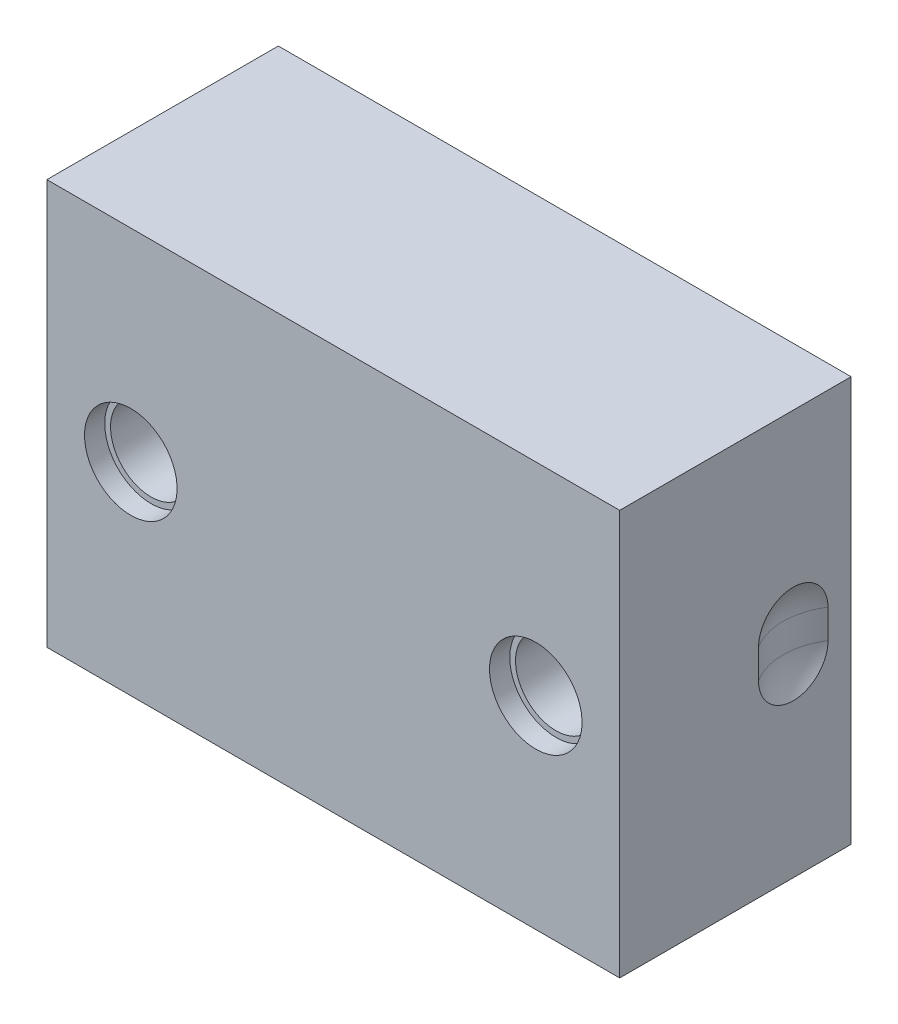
ISO-10303-21;
HEADER;
FILE_DESCRIPTION(('STEP AP214'),'2;1');
FILE_NAME('part.step','',(''),(''),'','','');
FILE_SCHEMA(('AUTOMOTIVE_DESIGN { 1 0 10303 214 1 1 1 1 }'));
ENDSEC;
DATA;
#1=APPLICATION_CONTEXT('core data for automotive mechanical design processes');
#2=APPLICATION_PROTOCOL_DEFINITION('international standard','automotive_design',2000,#1);
#3=PRODUCT_CONTEXT('',#1,'mechanical');
#4=PRODUCT('Part','Part','',(#3));
#5=PRODUCT_RELATED_PRODUCT_CATEGORY('part','',(#4));
#6=PRODUCT_DEFINITION_FORMATION('','',#4);
#7=PRODUCT_DEFINITION_CONTEXT('part definition',#1,'design');
#8=PRODUCT_DEFINITION('design','',#6,#7);
#9=PRODUCT_DEFINITION_SHAPE('','',#8);
#10=(LENGTH_UNIT() NAMED_UNIT(*) SI_UNIT(.MILLI.,.METRE.));
#11=(NAMED_UNIT(*) PLANE_ANGLE_UNIT() SI_UNIT($,.RADIAN.));
#12=(NAMED_UNIT(*) SI_UNIT($,.STERADIAN.) SOLID_ANGLE_UNIT());
#13=UNCERTAINTY_MEASURE_WITH_UNIT(LENGTH_MEASURE(1.E-05),#10,'distance_accuracy_value','');
#14=(GEOMETRIC_REPRESENTATION_CONTEXT(3) GLOBAL_UNCERTAINTY_ASSIGNED_CONTEXT((#13)) GLOBAL_UNIT_ASSIGNED_CONTEXT((#10,
#11,#12)) REPRESENTATION_CONTEXT('',''));
#15=CARTESIAN_POINT('',(0.,0.,0.));
#16=DIRECTION('',(0.,0.,1.));
#17=DIRECTION('',(1.,0.,0.));
#18=AXIS2_PLACEMENT_3D('',#15,#16,#17);
#19=CARTESIAN_POINT('',(-849.045422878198,315.473192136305,8.));
#20=DIRECTION('',(0.,0.,-1.));
#21=DIRECTION('',(-1.,0.,0.));
#22=AXIS2_PLACEMENT_3D('',#19,#20,#21);
#23=PLANE('',#22);
#24=CARTESIAN_POINT('',(-849.045422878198,315.473192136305,8.));
#25=DIRECTION('',(0.,0.,1.));
#26=DIRECTION('',(1.,0.,0.));
#27=AXIS2_PLACEMENT_3D('',#24,#25,#26);
#28=CIRCLE('',#27,7.);
#29=CARTESIAN_POINT('',(-842.045422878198,315.473192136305,8.));
#30=VERTEX_POINT('',#29);
#31=EDGE_CURVE('E325',#30,#30,#28,.T.);
#32=ORIENTED_EDGE('',*,*,#31,.T.);
#33=EDGE_LOOP('',(#32));
#34=FACE_BOUND('',#33,.T.);
#35=CARTESIAN_POINT('',(-849.045422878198,315.473192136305,7.99999999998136));
#36=DIRECTION('',(0.,0.,1.));
#37=DIRECTION('',(1.,0.,0.));
#38=AXIS2_PLACEMENT_3D('',#35,#36,#37);
#39=CIRCLE('',#38,4.99999999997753);
#40=CARTESIAN_POINT('',(-844.04542287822,315.473192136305,7.99999999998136));
#41=VERTEX_POINT('',#40);
#42=EDGE_CURVE('E18',#41,#41,#39,.F.);
#43=ORIENTED_EDGE('',*,*,#42,.T.);
#44=EDGE_LOOP('',(#43));
#45=FACE_BOUND('',#44,.T.);
#46=ADVANCED_FACE('F14',(#34,#45),#23,.F.);
#47=CARTESIAN_POINT('',(-919.045422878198,315.473192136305,8.00000000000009));
#48=DIRECTION('',(0.,0.,-1.));
#49=DIRECTION('',(-1.,0.,0.));
#50=AXIS2_PLACEMENT_3D('',#47,#48,#49);
#51=PLANE('',#50);
#52=CARTESIAN_POINT('',(-919.045422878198,315.473192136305,8.0000000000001));
#53=DIRECTION('',(0.,0.,1.));
#54=DIRECTION('',(1.,0.,0.));
#55=AXIS2_PLACEMENT_3D('',#52,#53,#54);
#56=CIRCLE('',#55,7.);
#57=CARTESIAN_POINT('',(-912.045422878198,315.473192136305,8.0000000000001));
#58=VERTEX_POINT('',#57);
#59=EDGE_CURVE('E321',#58,#58,#56,.T.);
#60=ORIENTED_EDGE('',*,*,#59,.T.);
#61=EDGE_LOOP('',(#60));
#62=FACE_BOUND('',#61,.T.);
#63=CARTESIAN_POINT('',(-919.045422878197,315.473192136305,7.99999999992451));
#64=DIRECTION('',(0.,0.,1.));
#65=DIRECTION('',(1.,0.,0.));
#66=AXIS2_PLACEMENT_3D('',#63,#64,#65);
#67=CIRCLE('',#66,4.99999999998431);
#68=CARTESIAN_POINT('',(-914.045422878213,315.473192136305,7.99999999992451));
#69=VERTEX_POINT('',#68);
#70=EDGE_CURVE('E327',#69,#69,#67,.F.);
#71=ORIENTED_EDGE('',*,*,#70,.T.);
#72=EDGE_LOOP('',(#71));
#73=FACE_BOUND('',#72,.T.);
#74=ADVANCED_FACE('F339',(#62,#73),#51,.F.);
#75=CARTESIAN_POINT('',(-849.045422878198,315.473192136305,7.99999999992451));
#76=DIRECTION('',(0.,0.,1.));
#77=DIRECTION('',(1.,0.,0.));
#78=AXIS2_PLACEMENT_3D('',#75,#76,#77);
#79=CONICAL_SURFACE('',#78,4.99999999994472,0.523598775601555);
#80=ORIENTED_EDGE('',*,*,#42,.F.);
#81=EDGE_LOOP('',(#80));
#82=FACE_BOUND('',#81,.T.);
#83=CARTESIAN_POINT('',(-849.045422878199,315.473192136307,6.61435935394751));
#84=DIRECTION('',(6.07971206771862E-13,-4.81229605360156E-13,-1.));
#85=DIRECTION('',(-1.,0.,-6.07971206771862E-13));
#86=AXIS2_PLACEMENT_3D('',#83,#84,#85);
#87=CIRCLE('',#86,4.2);
#88=CARTESIAN_POINT('',(-853.245422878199,315.473192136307,6.61435935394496));
#89=VERTEX_POINT('',#88);
#90=EDGE_CURVE('E324',#89,#89,#87,.T.);
#91=ORIENTED_EDGE('',*,*,#90,.T.);
#92=EDGE_LOOP('',(#91));
#93=FACE_BOUND('',#92,.T.);
#94=ADVANCED_FACE('F335',(#82,#93),#79,.F.);
#95=CARTESIAN_POINT('',(-919.045422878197,315.473192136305,7.99999999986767));
#96=DIRECTION('',(0.,0.,1.));
#97=DIRECTION('',(1.,0.,0.));
#98=AXIS2_PLACEMENT_3D('',#95,#96,#97);
#99=CONICAL_SURFACE('',#98,4.99999999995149,0.523598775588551);
#100=CARTESIAN_POINT('',(-919.045422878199,315.473192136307,6.61435935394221));
#101=DIRECTION('',(6.56531207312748E-13,-5.27037872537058E-13,-1.));
#102=DIRECTION('',(-1.,0.,-6.56531207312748E-13));
#103=AXIS2_PLACEMENT_3D('',#100,#101,#102);
#104=CIRCLE('',#103,4.2);
#105=CARTESIAN_POINT('',(-923.245422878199,315.473192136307,6.61435935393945));
#106=VERTEX_POINT('',#105);
#107=EDGE_CURVE('E320',#106,#106,#104,.T.);
#108=ORIENTED_EDGE('',*,*,#107,.T.);
#109=EDGE_LOOP('',(#108));
#110=FACE_BOUND('',#109,.T.);
#111=ORIENTED_EDGE('',*,*,#70,.F.);
#112=EDGE_LOOP('',(#111));
#113=FACE_BOUND('',#112,.T.);
#114=ADVANCED_FACE('F338',(#110,#113),#99,.F.);
#115=CARTESIAN_POINT('',(-849.045422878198,315.473192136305,24.));
#116=DIRECTION('',(0.,0.,1.));
#117=DIRECTION('',(1.,0.,0.));
#118=AXIS2_PLACEMENT_3D('',#115,#116,#117);
#119=CYLINDRICAL_SURFACE('',#118,7.);
#120=ORIENTED_EDGE('',*,*,#31,.F.);
#121=EDGE_LOOP('',(#120));
#122=FACE_BOUND('',#121,.T.);
#123=CARTESIAN_POINT('',(-849.045422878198,315.473192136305,36.5));
#124=DIRECTION('',(0.,0.,1.));
#125=DIRECTION('',(1.,0.,0.));
#126=AXIS2_PLACEMENT_3D('',#123,#124,#125);
#127=CIRCLE('',#126,7.);
#128=CARTESIAN_POINT('',(-842.045422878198,315.473192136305,36.5));
#129=VERTEX_POINT('',#128);
#130=EDGE_CURVE('E317',#129,#129,#127,.T.);
#131=ORIENTED_EDGE('',*,*,#130,.T.);
#132=EDGE_LOOP('',(#131));
#133=FACE_BOUND('',#132,.T.);
#134=ADVANCED_FACE('F867',(#122,#133),#119,.F.);
#135=CARTESIAN_POINT('',(-919.045422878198,315.473192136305,24.));
#136=DIRECTION('',(0.,0.,1.));
#137=DIRECTION('',(1.,0.,0.));
#138=AXIS2_PLACEMENT_3D('',#135,#136,#137);
#139=CYLINDRICAL_SURFACE('',#138,7.);
#140=ORIENTED_EDGE('',*,*,#59,.F.);
#141=EDGE_LOOP('',(#140));
#142=FACE_BOUND('',#141,.T.);
#143=CARTESIAN_POINT('',(-919.045422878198,315.473192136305,36.5));
#144=DIRECTION('',(0.,0.,1.));
#145=DIRECTION('',(1.,0.,0.));
#146=AXIS2_PLACEMENT_3D('',#143,#144,#145);
#147=CIRCLE('',#146,7.);
#148=CARTESIAN_POINT('',(-912.045422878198,315.473192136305,36.5));
#149=VERTEX_POINT('',#148);
#150=EDGE_CURVE('E314',#149,#149,#147,.T.);
#151=ORIENTED_EDGE('',*,*,#150,.T.);
#152=EDGE_LOOP('',(#151));
#153=FACE_BOUND('',#152,.T.);
#154=ADVANCED_FACE('F864',(#142,#153),#139,.F.);
#155=CARTESIAN_POINT('',(-849.045422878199,315.473192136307,6.61435935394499));
#156=DIRECTION('',(6.07971206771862E-13,-4.81229605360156E-13,-1.));
#157=DIRECTION('',(-1.,0.,-6.07971206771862E-13));
#158=AXIS2_PLACEMENT_3D('',#155,#156,#157);
#159=CYLINDRICAL_SURFACE('',#158,4.2);
#160=ORIENTED_EDGE('',*,*,#90,.F.);
#161=EDGE_LOOP('',(#160));
#162=FACE_BOUND('',#161,.T.);
#163=CARTESIAN_POINT('',(-849.045422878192,315.473192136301,-5.00000000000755));
#164=DIRECTION('',(6.07971206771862E-13,-4.81229605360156E-13,-1.));
#165=DIRECTION('',(-1.,0.,-6.07971206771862E-13));
#166=AXIS2_PLACEMENT_3D('',#163,#164,#165);
#167=CIRCLE('',#166,4.2);
#168=CARTESIAN_POINT('',(-853.245422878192,315.473192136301,-5.0000000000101));
#169=VERTEX_POINT('',#168);
#170=EDGE_CURVE('E311',#169,#169,#167,.F.);
#171=ORIENTED_EDGE('',*,*,#170,.F.);
#172=EDGE_LOOP('',(#171));
#173=FACE_BOUND('',#172,.T.);
#174=ADVANCED_FACE('F860',(#162,#173),#159,.F.);
#175=CARTESIAN_POINT('',(-919.045422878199,315.473192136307,6.61435935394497));
#176=DIRECTION('',(6.56531207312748E-13,-5.27037872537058E-13,-1.));
#177=DIRECTION('',(-1.,0.,-6.56531207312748E-13));
#178=AXIS2_PLACEMENT_3D('',#175,#176,#177);
#179=CYLINDRICAL_SURFACE('',#178,4.2);
#180=CARTESIAN_POINT('',(-919.045422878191,315.473192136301,-4.99999999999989));
#181=DIRECTION('',(6.56531207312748E-13,-5.27037872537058E-13,-1.));
#182=DIRECTION('',(-1.,0.,-6.56531207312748E-13));
#183=AXIS2_PLACEMENT_3D('',#180,#181,#182);
#184=CIRCLE('',#183,4.2);
#185=CARTESIAN_POINT('',(-923.245422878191,315.473192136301,-5.00000000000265));
#186=VERTEX_POINT('',#185);
#187=EDGE_CURVE('E308',#186,#186,#184,.T.);
#188=ORIENTED_EDGE('',*,*,#187,.T.);
#189=EDGE_LOOP('',(#188));
#190=FACE_BOUND('',#189,.T.);
#191=ORIENTED_EDGE('',*,*,#107,.F.);
#192=EDGE_LOOP('',(#191));
#193=FACE_BOUND('',#192,.T.);
#194=ADVANCED_FACE('F856',(#190,#193),#179,.F.);
#195=CARTESIAN_POINT('',(-849.045422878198,315.473192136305,36.5));
#196=DIRECTION('',(0.,0.,-1.));
#197=DIRECTION('',(-1.,0.,0.));
#198=AXIS2_PLACEMENT_3D('',#195,#196,#197);
#199=PLANE('',#198);
#200=CARTESIAN_POINT('',(-849.045422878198,315.473192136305,36.5));
#201=DIRECTION('',(0.,0.,-1.));
#202=DIRECTION('',(-1.,0.,0.));
#203=AXIS2_PLACEMENT_3D('',#200,#201,#202);
#204=CIRCLE('',#203,8.);
#205=CARTESIAN_POINT('',(-857.045422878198,315.473192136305,36.5));
#206=VERTEX_POINT('',#205);
#207=EDGE_CURVE('E305',#206,#206,#204,.F.);
#208=ORIENTED_EDGE('',*,*,#207,.T.);
#209=EDGE_LOOP('',(#208));
#210=FACE_BOUND('',#209,.T.);
#211=ORIENTED_EDGE('',*,*,#130,.F.);
#212=EDGE_LOOP('',(#211));
#213=FACE_BOUND('',#212,.T.);
#214=ADVANCED_FACE('F852',(#210,#213),#199,.F.);
#215=CARTESIAN_POINT('',(-919.045422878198,315.473192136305,36.5));
#216=DIRECTION('',(0.,0.,-1.));
#217=DIRECTION('',(-1.,0.,0.));
#218=AXIS2_PLACEMENT_3D('',#215,#216,#217);
#219=PLANE('',#218);
#220=CARTESIAN_POINT('',(-919.045422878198,315.473192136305,36.5));
#221=DIRECTION('',(0.,0.,-1.));
#222=DIRECTION('',(-1.,0.,0.));
#223=AXIS2_PLACEMENT_3D('',#220,#221,#222);
#224=CIRCLE('',#223,8.);
#225=CARTESIAN_POINT('',(-927.045422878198,315.473192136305,36.5));
#226=VERTEX_POINT('',#225);
#227=EDGE_CURVE('E218',#226,#226,#224,.F.);
#228=ORIENTED_EDGE('',*,*,#227,.T.);
#229=EDGE_LOOP('',(#228));
#230=FACE_BOUND('',#229,.T.);
#231=ORIENTED_EDGE('',*,*,#150,.F.);
#232=EDGE_LOOP('',(#231));
#233=FACE_BOUND('',#232,.T.);
#234=ADVANCED_FACE('F849',(#230,#233),#219,.F.);
#235=CARTESIAN_POINT('',(-842.945422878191,312.59293601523,-4.9999999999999));
#236=DIRECTION('',(0.,0.,-1.));
#237=DIRECTION('',(-1.,0.,0.));
#238=AXIS2_PLACEMENT_3D('',#235,#236,#237);
#239=PLANE('',#238);
#240=DIRECTION('',(0.,1.,0.));
#241=VECTOR('',#240,1.);
#242=CARTESIAN_POINT('',(-854.14542287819,315.4731921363,-4.99999999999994));
#243=LINE('',#242,#241);
#244=CARTESIAN_POINT('',(-854.14542287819,317.939234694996,-5.));
#245=VERTEX_POINT('',#244);
#246=CARTESIAN_POINT('',(-854.14542287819,313.007149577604,-4.99999999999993));
#247=VERTEX_POINT('',#246);
#248=EDGE_CURVE('E225',#245,#247,#243,.F.);
#249=ORIENTED_EDGE('',*,*,#248,.F.);
#250=DIRECTION('',(-0.707106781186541,-0.707106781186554,0.));
#251=VECTOR('',#250,1.);
#252=CARTESIAN_POINT('',(-850.907832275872,321.176825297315,-4.99999999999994));
#253=LINE('',#252,#251);
#254=CARTESIAN_POINT('',(-850.907832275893,321.176825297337,-4.99999999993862));
#255=VERTEX_POINT('',#254);
#256=EDGE_CURVE('E212',#255,#245,#253,.T.);
#257=ORIENTED_EDGE('',*,*,#256,.F.);
#258=CARTESIAN_POINT('',(-849.045422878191,315.4731921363,-4.99999999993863));
#259=DIRECTION('',(0.,0.,1.));
#260=DIRECTION('',(1.,0.,0.));
#261=AXIS2_PLACEMENT_3D('',#258,#259,#260);
#262=CIRCLE('',#261,6.00000000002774);
#263=CARTESIAN_POINT('',(-850.907832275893,309.769558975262,-4.99999999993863));
#264=VERTEX_POINT('',#263);
#265=EDGE_CURVE('E205',#264,#255,#262,.T.);
#266=ORIENTED_EDGE('',*,*,#265,.F.);
#267=DIRECTION('',(0.707106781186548,-0.707106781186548,0.));
#268=VECTOR('',#267,1.);
#269=CARTESIAN_POINT('',(-854.14542287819,313.007149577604,-4.99999999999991));
#270=LINE('',#269,#268);
#271=EDGE_CURVE('E210',#247,#264,#270,.T.);
#272=ORIENTED_EDGE('',*,*,#271,.F.);
#273=EDGE_LOOP('',(#249,#257,#266,#272));
#274=FACE_BOUND('',#273,.T.);
#275=ORIENTED_EDGE('',*,*,#170,.T.);
#276=EDGE_LOOP('',(#275));
#277=FACE_BOUND('',#276,.T.);
#278=ADVANCED_FACE('F208',(#274,#277),#239,.T.);
#279=CARTESIAN_POINT('',(-919.04542287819,315.4731921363,-4.99999999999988));
#280=DIRECTION('',(0.,0.,1.));
#281=DIRECTION('',(0.,-1.,0.));
#282=AXIS2_PLACEMENT_3D('',#279,#280,#281);
#283=PLANE('',#282);
#284=DIRECTION('',(0.707106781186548,0.707106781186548,0.));
#285=VECTOR('',#284,1.);
#286=CARTESIAN_POINT('',(-917.183013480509,309.769558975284,-4.99999999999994));
#287=LINE('',#286,#285);
#288=CARTESIAN_POINT('',(-917.183013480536,309.769558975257,-5.00000000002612));
#289=VERTEX_POINT('',#288);
#290=CARTESIAN_POINT('',(-913.341789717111,313.61078273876,-5.00000000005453));
#291=VERTEX_POINT('',#290);
#292=EDGE_CURVE('E275',#289,#291,#287,.T.);
#293=ORIENTED_EDGE('',*,*,#292,.F.);
#294=CARTESIAN_POINT('',(-919.04542287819,315.4731921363,-5.00000000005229));
#295=DIRECTION('',(0.,0.,1.));
#296=DIRECTION('',(1.,0.,0.));
#297=AXIS2_PLACEMENT_3D('',#294,#295,#296);
#298=CIRCLE('',#297,6.00000000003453);
#299=CARTESIAN_POINT('',(-920.90783227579,309.769558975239,-5.00000000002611));
#300=VERTEX_POINT('',#299);
#301=EDGE_CURVE('E300',#300,#289,#298,.T.);
#302=ORIENTED_EDGE('',*,*,#301,.F.);
#303=DIRECTION('',(0.707106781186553,-0.707106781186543,0.));
#304=VECTOR('',#303,1.);
#305=CARTESIAN_POINT('',(-924.749056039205,313.610782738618,-4.9999999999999));
#306=LINE('',#305,#304);
#307=CARTESIAN_POINT('',(-924.749056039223,313.610782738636,-5.0000000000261));
#308=VERTEX_POINT('',#307);
#309=EDGE_CURVE('E683',#308,#300,#306,.T.);
#310=ORIENTED_EDGE('',*,*,#309,.F.);
#311=CARTESIAN_POINT('',(-919.04542287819,315.4731921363,-5.00000000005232));
#312=DIRECTION('',(0.,0.,1.));
#313=DIRECTION('',(1.,0.,0.));
#314=AXIS2_PLACEMENT_3D('',#311,#312,#313);
#315=CIRCLE('',#314,6.00000000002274);
#316=CARTESIAN_POINT('',(-924.749056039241,317.335601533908,-5.00000000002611));
#317=VERTEX_POINT('',#316);
#318=EDGE_CURVE('E666',#317,#308,#315,.T.);
#319=ORIENTED_EDGE('',*,*,#318,.F.);
#320=DIRECTION('',(-0.707106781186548,-0.707106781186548,0.));
#321=VECTOR('',#320,1.);
#322=CARTESIAN_POINT('',(-920.907832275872,321.176825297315,-4.9999999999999));
#323=LINE('',#322,#321);
#324=CARTESIAN_POINT('',(-920.907832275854,321.176825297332,-4.99999999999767));
#325=VERTEX_POINT('',#324);
#326=EDGE_CURVE('E682',#325,#317,#323,.T.);
#327=ORIENTED_EDGE('',*,*,#326,.F.);
#328=CARTESIAN_POINT('',(-919.04542287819,315.4731921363,-4.99999999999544));
#329=DIRECTION('',(0.,0.,1.));
#330=DIRECTION('',(1.,0.,0.));
#331=AXIS2_PLACEMENT_3D('',#328,#329,#330);
#332=CIRCLE('',#331,6.00000000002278);
#333=CARTESIAN_POINT('',(-917.183013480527,321.176825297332,-4.99999999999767));
#334=VERTEX_POINT('',#333);
#335=EDGE_CURVE('E653',#334,#325,#332,.T.);
#336=ORIENTED_EDGE('',*,*,#335,.F.);
#337=DIRECTION('',(-0.707106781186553,0.707106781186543,0.));
#338=VECTOR('',#337,1.);
#339=CARTESIAN_POINT('',(-913.341789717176,317.335601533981,-4.99999999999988));
#340=LINE('',#339,#338);
#341=CARTESIAN_POINT('',(-913.341789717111,317.335601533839,-5.00000000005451));
#342=VERTEX_POINT('',#341);
#343=EDGE_CURVE('E649',#342,#334,#340,.T.);
#344=ORIENTED_EDGE('',*,*,#343,.F.);
#345=CARTESIAN_POINT('',(-919.04542287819,315.4731921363,-5.00000000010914));
#346=DIRECTION('',(0.,0.,1.));
#347=DIRECTION('',(1.,0.,0.));
#348=AXIS2_PLACEMENT_3D('',#345,#346,#347);
#349=CIRCLE('',#348,6.00000000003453);
#350=EDGE_CURVE('E276',#291,#342,#349,.T.);
#351=ORIENTED_EDGE('',*,*,#350,.F.);
#352=EDGE_LOOP('',(#293,#302,#310,#319,#327,#336,#344,#351));
#353=FACE_BOUND('',#352,.T.);
#354=ORIENTED_EDGE('',*,*,#187,.F.);
#355=EDGE_LOOP('',(#354));
#356=FACE_BOUND('',#355,.T.);
#357=ADVANCED_FACE('F839',(#353,#356),#283,.F.);
#358=CARTESIAN_POINT('',(-849.045422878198,315.473192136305,23.25));
#359=DIRECTION('',(0.,0.,-1.));
#360=DIRECTION('',(-1.,0.,0.));
#361=AXIS2_PLACEMENT_3D('',#358,#359,#360);
#362=CYLINDRICAL_SURFACE('',#361,8.);
#363=ORIENTED_EDGE('',*,*,#207,.F.);
#364=EDGE_LOOP('',(#363));
#365=FACE_BOUND('',#364,.T.);
#366=CARTESIAN_POINT('',(-849.045422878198,315.473192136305,40.));
#367=DIRECTION('',(0.,0.,-1.));
#368=DIRECTION('',(-1.,0.,0.));
#369=AXIS2_PLACEMENT_3D('',#366,#367,#368);
#370=CIRCLE('',#369,8.);
#371=CARTESIAN_POINT('',(-857.045422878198,315.473192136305,40.));
#372=VERTEX_POINT('',#371);
#373=EDGE_CURVE('E818',#372,#372,#370,.T.);
#374=ORIENTED_EDGE('',*,*,#373,.F.);
#375=EDGE_LOOP('',(#374));
#376=FACE_BOUND('',#375,.T.);
#377=ADVANCED_FACE('F832',(#365,#376),#362,.F.);
#378=CARTESIAN_POINT('',(-919.045422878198,315.473192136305,23.25));
#379=DIRECTION('',(0.,0.,-1.));
#380=DIRECTION('',(-1.,0.,0.));
#381=AXIS2_PLACEMENT_3D('',#378,#379,#380);
#382=CYLINDRICAL_SURFACE('',#381,8.);
#383=ORIENTED_EDGE('',*,*,#227,.F.);
#384=EDGE_LOOP('',(#383));
#385=FACE_BOUND('',#384,.T.);
#386=CARTESIAN_POINT('',(-919.045422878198,315.473192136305,40.));
#387=DIRECTION('',(0.,0.,-1.));
#388=DIRECTION('',(-1.,0.,0.));
#389=AXIS2_PLACEMENT_3D('',#386,#387,#388);
#390=CIRCLE('',#389,8.);
#391=CARTESIAN_POINT('',(-927.045422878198,315.473192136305,40.));
#392=VERTEX_POINT('',#391);
#393=EDGE_CURVE('E532',#392,#392,#390,.T.);
#394=ORIENTED_EDGE('',*,*,#393,.F.);
#395=EDGE_LOOP('',(#394));
#396=FACE_BOUND('',#395,.T.);
#397=ADVANCED_FACE('F830',(#385,#396),#382,.F.);
#398=CARTESIAN_POINT('',(-849.045422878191,315.4731921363,-4.00000000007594));
#399=DIRECTION('',(0.,0.,1.));
#400=DIRECTION('',(1.,0.,0.));
#401=AXIS2_PLACEMENT_3D('',#398,#399,#400);
#402=CONICAL_SURFACE('',#401,6.99999999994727,0.785398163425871);
#403=CARTESIAN_POINT('',(-850.907832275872,309.769558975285,-4.99999999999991));
#404=CARTESIAN_POINT('',(-851.165881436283,309.349155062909,-4.52026123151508));
#405=CARTESIAN_POINT('',(-851.452584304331,308.900097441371,-3.99999999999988));
#406=B_SPLINE_CURVE_WITH_KNOTS('',2,(#403,#404,#405),.UNSPECIFIED.,.F.,.F.,(3,3),(0.,1.),.UNSPECIFIED.);
#407=CARTESIAN_POINT('',(-851.452584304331,308.90009744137,-3.9999999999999));
#408=VERTEX_POINT('',#407);
#409=EDGE_CURVE('E217',#264,#408,#406,.T.);
#410=ORIENTED_EDGE('',*,*,#409,.F.);
#411=ORIENTED_EDGE('',*,*,#265,.T.);
#412=CARTESIAN_POINT('',(-851.452584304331,322.046286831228,-3.99999999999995));
#413=CARTESIAN_POINT('',(-851.165881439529,321.597229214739,-4.52026122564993));
#414=CARTESIAN_POINT('',(-850.907832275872,321.176825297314,-4.99999999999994));
#415=B_SPLINE_CURVE_WITH_KNOTS('',2,(#412,#413,#414),.UNSPECIFIED.,.F.,.F.,(3,3),(0.,1.),.UNSPECIFIED.);
#416=CARTESIAN_POINT('',(-851.452584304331,322.046286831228,-3.99999999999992));
#417=VERTEX_POINT('',#416);
#418=EDGE_CURVE('E259',#417,#255,#415,.T.);
#419=ORIENTED_EDGE('',*,*,#418,.F.);
#420=CARTESIAN_POINT('',(-849.045422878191,315.4731921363,-3.9999999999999));
#421=DIRECTION('',(0.,0.,-1.));
#422=DIRECTION('',(-1.,0.,0.));
#423=AXIS2_PLACEMENT_3D('',#420,#421,#422);
#424=CIRCLE('',#423,7.);
#425=CARTESIAN_POINT('',(-846.638261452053,322.046286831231,-4.0000000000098));
#426=VERTEX_POINT('',#425);
#427=EDGE_CURVE('E529',#426,#417,#424,.F.);
#428=ORIENTED_EDGE('',*,*,#427,.F.);
#429=CARTESIAN_POINT('',(-842.94542287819,318.353448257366,-4.25419572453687));
#430=CARTESIAN_POINT('',(-843.014201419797,318.422226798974,-4.28702262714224));
#431=CARTESIAN_POINT('',(-843.083377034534,318.491402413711,-4.31817573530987));
#432=CARTESIAN_POINT('',(-843.222516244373,318.630541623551,-4.37683860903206));
#433=CARTESIAN_POINT('',(-843.292480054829,318.700505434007,-4.40434735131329));
#434=CARTESIAN_POINT('',(-843.503672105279,318.911697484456,-4.48100425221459));
#435=CARTESIAN_POINT('',(-843.64601913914,319.054044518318,-4.52419474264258));
#436=CARTESIAN_POINT('',(-843.931479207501,319.339504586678,-4.59206614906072));
#437=CARTESIAN_POINT('',(-844.074570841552,319.482596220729,-4.61692541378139));
#438=CARTESIAN_POINT('',(-844.361691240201,319.769716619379,-4.64732037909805));
#439=CARTESIAN_POINT('',(-844.505719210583,319.91374458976,-4.65287074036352));
#440=CARTESIAN_POINT('',(-844.790672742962,320.19869812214,-4.64441183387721));
#441=CARTESIAN_POINT('',(-844.931604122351,320.339629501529,-4.63078119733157));
#442=CARTESIAN_POINT('',(-845.212040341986,320.620065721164,-4.58546330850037));
#443=CARTESIAN_POINT('',(-845.3515446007,320.759569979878,-4.55376897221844));
#444=CARTESIAN_POINT('',(-845.628214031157,321.036239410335,-4.47404595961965));
#445=CARTESIAN_POINT('',(-845.765378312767,321.173403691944,-4.4260112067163));
#446=CARTESIAN_POINT('',(-846.036831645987,321.444857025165,-4.31579736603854));
#447=CARTESIAN_POINT('',(-846.171120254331,321.57914563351,-4.25361611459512));
#448=CARTESIAN_POINT('',(-846.360202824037,321.768228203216,-4.15658213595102));
#449=CARTESIAN_POINT('',(-846.416274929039,321.824300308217,-4.12659310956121));
#450=CARTESIAN_POINT('',(-846.527740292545,321.935765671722,-4.06470299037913));
#451=CARTESIAN_POINT('',(-846.583134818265,321.991160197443,-4.03280646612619));
#452=CARTESIAN_POINT('',(-846.638261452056,322.046286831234,-4.00000000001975));
#453=B_SPLINE_CURVE_WITH_KNOTS('',3,(#429,#430,#431,#432,#433,#434,#435,#436,#437,#438,#439,
#440,#441,#442,#443,#444,#445,#446,#447,#448,#449,#450,#451,#452),.UNSPECIFIED.,.F.,.F.,(4,2,2,
2,2,2,2,2,2,2,2,4),(0.,0.307945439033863,0.615977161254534,1.23285410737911,1.84364713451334,
2.45397630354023,3.05242522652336,3.65110900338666,4.25001565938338,4.84901397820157,
5.10333181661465,5.35706321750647),.UNSPECIFIED.);
#454=CARTESIAN_POINT('',(-842.94542287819,318.35344825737,-4.25419572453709));
#455=VERTEX_POINT('',#454);
#456=EDGE_CURVE('E531',#455,#426,#453,.T.);
#457=ORIENTED_EDGE('',*,*,#456,.F.);
#458=CARTESIAN_POINT('',(-842.945422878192,312.592936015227,-4.25419572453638));
#459=CARTESIAN_POINT('',(-842.945422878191,312.80236724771,-4.34361886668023));
#460=CARTESIAN_POINT('',(-842.945422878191,313.014931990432,-4.42640658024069));
#461=CARTESIAN_POINT('',(-842.945422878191,313.44655932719,-4.57535259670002));
#462=CARTESIAN_POINT('',(-842.945422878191,313.665641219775,-4.64145454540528));
#463=CARTESIAN_POINT('',(-842.945422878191,314.106794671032,-4.75243814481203));
#464=CARTESIAN_POINT('',(-842.945422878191,314.328810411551,-4.79753603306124));
#465=CARTESIAN_POINT('',(-842.945422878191,314.776102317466,-4.86427053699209));
#466=CARTESIAN_POINT('',(-842.945422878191,315.001373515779,-4.88593971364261));
#467=CARTESIAN_POINT('',(-842.945422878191,315.440018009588,-4.90361996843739));
#468=CARTESIAN_POINT('',(-842.945422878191,315.653334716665,-4.90102795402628));
#469=CARTESIAN_POINT('',(-842.945422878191,316.078625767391,-4.87370599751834));
#470=CARTESIAN_POINT('',(-842.945422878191,316.290599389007,-4.84896502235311));
#471=CARTESIAN_POINT('',(-842.945422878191,316.710982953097,-4.77913782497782));
#472=CARTESIAN_POINT('',(-842.945422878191,316.919394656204,-4.7340619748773));
#473=CARTESIAN_POINT('',(-842.945422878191,317.331612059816,-4.62629683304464));
#474=CARTESIAN_POINT('',(-842.945422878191,317.53541650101,-4.56360278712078));
#475=CARTESIAN_POINT('',(-842.945422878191,317.840945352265,-4.4573188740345));
#476=CARTESIAN_POINT('',(-842.945422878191,317.944575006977,-4.41906363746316));
#477=CARTESIAN_POINT('',(-842.945422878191,318.150173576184,-4.33912172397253));
#478=CARTESIAN_POINT('',(-842.945422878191,318.252146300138,-4.29744486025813));
#479=CARTESIAN_POINT('',(-842.945422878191,318.353448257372,-4.25419572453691));
#480=B_SPLINE_CURVE_WITH_KNOTS('',3,(#458,#459,#460,#461,#462,#463,#464,#465,#466,#467,#468,
#469,#470,#471,#472,#473,#474,#475,#476,#477,#478,#479),.UNSPECIFIED.,.F.,.F.,(4,2,2,2,2,2,2,2,
2,2,4),(0.,0.683472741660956,1.36922384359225,2.04774993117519,2.72533179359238,
3.36415122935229,4.00328905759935,4.64210125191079,5.28108599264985,5.6124280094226,
5.94285088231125),.UNSPECIFIED.);
#481=CARTESIAN_POINT('',(-842.94542287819,312.592936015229,-4.25419572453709));
#482=VERTEX_POINT('',#481);
#483=EDGE_CURVE('E569',#482,#455,#480,.T.);
#484=ORIENTED_EDGE('',*,*,#483,.F.);
#485=CARTESIAN_POINT('',(-846.638261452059,308.900097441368,-4.00000000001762));
#486=CARTESIAN_POINT('',(-846.483472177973,309.05488671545,-4.09213337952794));
#487=CARTESIAN_POINT('',(-846.326346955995,309.212011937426,-4.17718875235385));
#488=CARTESIAN_POINT('',(-846.007285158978,309.531073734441,-4.32962757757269));
#489=CARTESIAN_POINT('',(-845.845333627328,309.693025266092,-4.39694793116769));
#490=CARTESIAN_POINT('',(-845.523869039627,310.014489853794,-4.50753429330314));
#491=CARTESIAN_POINT('',(-845.364501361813,310.173857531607,-4.55162511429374));
#492=CARTESIAN_POINT('',(-845.043627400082,310.494731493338,-4.61649212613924));
#493=CARTESIAN_POINT('',(-844.882125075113,310.656233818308,-4.63730663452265));
#494=CARTESIAN_POINT('',(-844.572567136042,310.965791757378,-4.65338879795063));
#495=CARTESIAN_POINT('',(-844.42456480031,311.11379409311,-4.65072257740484));
#496=CARTESIAN_POINT('',(-844.129306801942,311.409052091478,-4.62489650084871));
#497=CARTESIAN_POINT('',(-843.982052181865,311.556306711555,-4.60171330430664));
#498=CARTESIAN_POINT('',(-843.684429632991,311.853929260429,-4.53512849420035));
#499=CARTESIAN_POINT('',(-843.534140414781,312.00421847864,-4.49102919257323));
#500=CARTESIAN_POINT('',(-843.311298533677,312.227060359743,-4.4115853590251));
#501=CARTESIAN_POINT('',(-843.237509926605,312.300848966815,-4.38291749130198));
#502=CARTESIAN_POINT('',(-843.090808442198,312.447550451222,-4.32151682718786));
#503=CARTESIAN_POINT('',(-843.017895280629,312.520463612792,-4.28878539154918));
#504=CARTESIAN_POINT('',(-842.945422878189,312.592936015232,-4.25419572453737));
#505=B_SPLINE_CURVE_WITH_KNOTS('',3,(#485,#486,#487,#488,#489,#490,#491,#492,#493,#494,#495,
#496,#497,#498,#499,#500,#501,#502,#503,#504),.UNSPECIFIED.,.F.,.F.,(4,2,2,2,2,2,2,2,2,4),(0.,
0.712841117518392,1.42818518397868,2.11604513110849,2.80277104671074,3.42971756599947,
4.05737823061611,4.70763029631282,5.0322192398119,5.3566997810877),.UNSPECIFIED.);
#506=CARTESIAN_POINT('',(-846.638261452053,308.900097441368,-4.0000000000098));
#507=VERTEX_POINT('',#506);
#508=EDGE_CURVE('E578',#507,#482,#505,.T.);
#509=ORIENTED_EDGE('',*,*,#508,.F.);
#510=CARTESIAN_POINT('',(-849.045422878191,315.4731921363,-3.9999999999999));
#511=DIRECTION('',(0.,0.,-1.));
#512=DIRECTION('',(-1.,0.,0.));
#513=AXIS2_PLACEMENT_3D('',#510,#511,#512);
#514=CIRCLE('',#513,7.);
#515=EDGE_CURVE('E230',#408,#507,#514,.F.);
#516=ORIENTED_EDGE('',*,*,#515,.F.);
#517=EDGE_LOOP('',(#410,#411,#419,#428,#457,#484,#509,#516));
#518=FACE_BOUND('',#517,.T.);
#519=ADVANCED_FACE('F228',(#518),#402,.T.);
#520=CARTESIAN_POINT('',(-851.741869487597,309.896489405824,-4.49999999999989));
#521=DIRECTION('',(-0.5,-0.5,-0.707106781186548));
#522=DIRECTION('',(-0.816496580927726,0.,0.577350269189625));
#523=AXIS2_PLACEMENT_3D('',#520,#521,#522);
#524=PLANE('',#523);
#525=DIRECTION('',(-0.678598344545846,-0.281084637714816,0.678598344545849));
#526=VECTOR('',#525,1.);
#527=CARTESIAN_POINT('',(-854.14542287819,313.007149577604,-4.99999999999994));
#528=LINE('',#527,#526);
#529=CARTESIAN_POINT('',(-855.14542287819,312.59293601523,-3.99999999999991));
#530=VERTEX_POINT('',#529);
#531=EDGE_CURVE('E224',#247,#530,#528,.T.);
#532=ORIENTED_EDGE('',*,*,#531,.F.);
#533=ORIENTED_EDGE('',*,*,#271,.T.);
#534=ORIENTED_EDGE('',*,*,#409,.T.);
#535=DIRECTION('',(0.707106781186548,-0.707106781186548,0.));
#536=VECTOR('',#535,1.);
#537=CARTESIAN_POINT('',(-855.14542287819,312.59293601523,-3.9999999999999));
#538=LINE('',#537,#536);
#539=EDGE_CURVE('E507',#530,#408,#538,.T.);
#540=ORIENTED_EDGE('',*,*,#539,.F.);
#541=EDGE_LOOP('',(#532,#533,#534,#540));
#542=FACE_BOUND('',#541,.T.);
#543=ADVANCED_FACE('F221',(#542),#524,.T.);
#544=CARTESIAN_POINT('',(-854.645422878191,315.4731921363,-4.49999999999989));
#545=DIRECTION('',(-0.707106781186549,0.,-0.707106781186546));
#546=DIRECTION('',(-0.707106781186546,0.,0.707106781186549));
#547=AXIS2_PLACEMENT_3D('',#544,#545,#546);
#548=PLANE('',#547);
#549=ORIENTED_EDGE('',*,*,#531,.T.);
#550=DIRECTION('',(0.,1.,0.));
#551=VECTOR('',#550,1.);
#552=CARTESIAN_POINT('',(-855.14542287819,318.353448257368,-3.9999999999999));
#553=LINE('',#552,#551);
#554=CARTESIAN_POINT('',(-855.14542287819,318.353448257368,-3.99999999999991));
#555=VERTEX_POINT('',#554);
#556=EDGE_CURVE('E502',#555,#530,#553,.F.);
#557=ORIENTED_EDGE('',*,*,#556,.F.);
#558=DIRECTION('',(-0.678598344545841,0.281084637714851,0.67859834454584));
#559=VECTOR('',#558,1.);
#560=CARTESIAN_POINT('',(-854.14542287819,317.939234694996,-5.));
#561=LINE('',#560,#559);
#562=EDGE_CURVE('E269',#245,#555,#561,.T.);
#563=ORIENTED_EDGE('',*,*,#562,.F.);
#564=ORIENTED_EDGE('',*,*,#248,.T.);
#565=EDGE_LOOP('',(#549,#557,#563,#564));
#566=FACE_BOUND('',#565,.T.);
#567=ADVANCED_FACE('F245',(#566),#548,.T.);
#568=CARTESIAN_POINT('',(-851.335578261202,321.456186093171,-4.49999999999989));
#569=DIRECTION('',(-0.5,0.5,-0.707106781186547));
#570=DIRECTION('',(0.,0.816496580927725,0.577350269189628));
#571=AXIS2_PLACEMENT_3D('',#568,#569,#570);
#572=PLANE('',#571);
#573=ORIENTED_EDGE('',*,*,#562,.T.);
#574=DIRECTION('',(-0.70710678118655,-0.707106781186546,0.));
#575=VECTOR('',#574,1.);
#576=CARTESIAN_POINT('',(-851.452584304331,322.046286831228,-3.9999999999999));
#577=LINE('',#576,#575);
#578=EDGE_CURVE('E493',#417,#555,#577,.T.);
#579=ORIENTED_EDGE('',*,*,#578,.F.);
#580=ORIENTED_EDGE('',*,*,#418,.T.);
#581=ORIENTED_EDGE('',*,*,#256,.T.);
#582=EDGE_LOOP('',(#573,#579,#580,#581));
#583=FACE_BOUND('',#582,.T.);
#584=ADVANCED_FACE('F250',(#583),#572,.T.);
#585=CARTESIAN_POINT('',(-919.04542287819,315.4731921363,-4.00000000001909));
#586=DIRECTION('',(0.,0.,1.));
#587=DIRECTION('',(1.,0.,0.));
#588=AXIS2_PLACEMENT_3D('',#585,#586,#587);
#589=CONICAL_SURFACE('',#588,7.00000000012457,0.785398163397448);
#590=CARTESIAN_POINT('',(-913.341789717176,313.610782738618,-4.9999999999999));
#591=CARTESIAN_POINT('',(-912.921385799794,313.352733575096,-4.52026122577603));
#592=CARTESIAN_POINT('',(-912.472328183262,313.066030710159,-3.9999999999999));
#593=B_SPLINE_CURVE_WITH_KNOTS('',2,(#590,#591,#592),.UNSPECIFIED.,.F.,.F.,(3,3),(0.,1.),.UNSPECIFIED.);
#594=CARTESIAN_POINT('',(-912.472328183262,313.066030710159,-3.99999999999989));
#595=VERTEX_POINT('',#594);
#596=EDGE_CURVE('E272',#291,#595,#593,.T.);
#597=ORIENTED_EDGE('',*,*,#596,.F.);
#598=ORIENTED_EDGE('',*,*,#350,.T.);
#599=CARTESIAN_POINT('',(-912.472328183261,317.88035356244,-3.99999999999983));
#600=CARTESIAN_POINT('',(-912.921385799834,317.593650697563,-4.5202612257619));
#601=CARTESIAN_POINT('',(-913.341789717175,317.335601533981,-4.99999999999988));
#602=B_SPLINE_CURVE_WITH_KNOTS('',2,(#599,#600,#601),.UNSPECIFIED.,.F.,.F.,(3,3),(0.,1.),.UNSPECIFIED.);
#603=CARTESIAN_POINT('',(-912.472328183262,317.88035356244,-3.99999999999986));
#604=VERTEX_POINT('',#603);
#605=EDGE_CURVE('E656',#604,#342,#602,.T.);
#606=ORIENTED_EDGE('',*,*,#605,.F.);
#607=CARTESIAN_POINT('',(-919.04542287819,315.4731921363,-3.99999999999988));
#608=DIRECTION('',(0.,0.,1.));
#609=DIRECTION('',(1.,0.,0.));
#610=AXIS2_PLACEMENT_3D('',#607,#608,#609);
#611=CIRCLE('',#610,7.);
#612=EDGE_CURVE('E490',#595,#604,#611,.T.);
#613=ORIENTED_EDGE('',*,*,#612,.F.);
#614=EDGE_LOOP('',(#597,#598,#606,#613));
#615=FACE_BOUND('',#614,.T.);
#616=ADVANCED_FACE('F255',(#615),#589,.T.);
#617=CARTESIAN_POINT('',(-913.867364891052,312.378100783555,-4.49999999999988));
#618=DIRECTION('',(0.5,-0.5,-0.707106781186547));
#619=DIRECTION('',(-0.816496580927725,0.,-0.577350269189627));
#620=AXIS2_PLACEMENT_3D('',#617,#618,#619);
#621=PLANE('',#620);
#622=CARTESIAN_POINT('',(-917.183013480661,309.769558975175,-5.00000000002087));
#623=CARTESIAN_POINT('',(-917.093412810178,309.623702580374,-4.83350671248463));
#624=CARTESIAN_POINT('',(-917.003216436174,309.478319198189,-4.66692666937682));
#625=CARTESIAN_POINT('',(-916.821632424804,309.188498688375,-4.33359333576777));
#626=CARTESIAN_POINT('',(-916.730244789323,309.044061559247,-4.1668400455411));
#627=CARTESIAN_POINT('',(-916.638261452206,308.90009744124,-4.00000000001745));
#628=B_SPLINE_CURVE_WITH_KNOTS('',3,(#622,#623,#624,#625,#626,#627),.UNSPECIFIED.,.F.,.F.,(4,2,
4),(0.,0.71636975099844,1.4327383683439),.UNSPECIFIED.);
#629=CARTESIAN_POINT('',(-916.638261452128,308.900097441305,-4.00000000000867));
#630=VERTEX_POINT('',#629);
#631=EDGE_CURVE('E293',#289,#630,#628,.T.);
#632=ORIENTED_EDGE('',*,*,#631,.F.);
#633=ORIENTED_EDGE('',*,*,#292,.T.);
#634=ORIENTED_EDGE('',*,*,#596,.T.);
#635=DIRECTION('',(0.707106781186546,0.70710678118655,0.));
#636=VECTOR('',#635,1.);
#637=CARTESIAN_POINT('',(-912.472328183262,313.066030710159,-3.99999999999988));
#638=LINE('',#637,#636);
#639=EDGE_CURVE('E486',#630,#595,#638,.T.);
#640=ORIENTED_EDGE('',*,*,#639,.F.);
#641=EDGE_LOOP('',(#632,#633,#634,#640));
#642=FACE_BOUND('',#641,.T.);
#643=ADVANCED_FACE('F278',(#642),#621,.T.);
#644=CARTESIAN_POINT('',(-919.04542287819,315.4731921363,-4.00000000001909));
#645=DIRECTION('',(0.,0.,1.));
#646=DIRECTION('',(1.,0.,0.));
#647=AXIS2_PLACEMENT_3D('',#644,#645,#646);
#648=CONICAL_SURFACE('',#647,7.00000000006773,0.785398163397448);
#649=CARTESIAN_POINT('',(-920.907832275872,309.769558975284,-4.99999999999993));
#650=CARTESIAN_POINT('',(-921.165881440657,309.349155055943,-4.52026122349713));
#651=CARTESIAN_POINT('',(-921.452584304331,308.900097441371,-3.99999999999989));
#652=B_SPLINE_CURVE_WITH_KNOTS('',2,(#649,#650,#651),.UNSPECIFIED.,.F.,.F.,(3,3),(0.,1.),.UNSPECIFIED.);
#653=CARTESIAN_POINT('',(-921.452584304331,308.90009744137,-3.99999999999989));
#654=VERTEX_POINT('',#653);
#655=EDGE_CURVE('E1230',#300,#654,#652,.T.);
#656=ORIENTED_EDGE('',*,*,#655,.F.);
#657=ORIENTED_EDGE('',*,*,#301,.T.);
#658=ORIENTED_EDGE('',*,*,#631,.T.);
#659=CARTESIAN_POINT('',(-919.04542287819,315.4731921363,-3.99999999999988));
#660=DIRECTION('',(0.,0.,1.));
#661=DIRECTION('',(1.,0.,0.));
#662=AXIS2_PLACEMENT_3D('',#659,#660,#661);
#663=CIRCLE('',#662,7.);
#664=EDGE_CURVE('E483',#654,#630,#663,.T.);
#665=ORIENTED_EDGE('',*,*,#664,.F.);
#666=EDGE_LOOP('',(#656,#657,#658,#665));
#667=FACE_BOUND('',#666,.T.);
#668=ADVANCED_FACE('F287',(#667),#648,.T.);
#669=CARTESIAN_POINT('',(-922.140514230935,310.295134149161,-4.49999999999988));
#670=DIRECTION('',(-0.5,-0.5,-0.707106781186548));
#671=DIRECTION('',(-0.816496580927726,0.,0.577350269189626));
#672=AXIS2_PLACEMENT_3D('',#669,#670,#671);
#673=PLANE('',#672);
#674=ORIENTED_EDGE('',*,*,#655,.T.);
#675=DIRECTION('',(0.707106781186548,-0.707106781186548,0.));
#676=VECTOR('',#675,1.);
#677=CARTESIAN_POINT('',(-921.452584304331,308.90009744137,-3.99999999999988));
#678=LINE('',#677,#676);
#679=CARTESIAN_POINT('',(-925.618517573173,313.066030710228,-4.00000000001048));
#680=VERTEX_POINT('',#679);
#681=EDGE_CURVE('E480',#680,#654,#678,.T.);
#682=ORIENTED_EDGE('',*,*,#681,.F.);
#683=CARTESIAN_POINT('',(-924.749056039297,313.610782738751,-5.00000000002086));
#684=CARTESIAN_POINT('',(-924.894912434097,313.521182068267,-4.83350671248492));
#685=CARTESIAN_POINT('',(-925.04029581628,313.430985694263,-4.66692666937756));
#686=CARTESIAN_POINT('',(-925.330116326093,313.249401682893,-4.33359333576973));
#687=CARTESIAN_POINT('',(-925.47455345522,313.158014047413,-4.16684004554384));
#688=CARTESIAN_POINT('',(-925.618517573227,313.066030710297,-4.00000000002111));
#689=B_SPLINE_CURVE_WITH_KNOTS('',3,(#683,#684,#685,#686,#687,#688),.UNSPECIFIED.,.F.,.F.,(4,2,
4),(0.,0.716369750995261,1.4327383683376),.UNSPECIFIED.);
#690=EDGE_CURVE('E1232',#308,#680,#689,.T.);
#691=ORIENTED_EDGE('',*,*,#690,.F.);
#692=ORIENTED_EDGE('',*,*,#309,.T.);
#693=EDGE_LOOP('',(#674,#682,#691,#692));
#694=FACE_BOUND('',#693,.T.);
#695=ADVANCED_FACE('F1157',(#694),#673,.T.);
#696=CARTESIAN_POINT('',(-919.04542287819,315.4731921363,-4.00000000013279));
#697=DIRECTION('',(0.,0.,1.));
#698=DIRECTION('',(1.,0.,0.));
#699=AXIS2_PLACEMENT_3D('',#696,#697,#698);
#700=CONICAL_SURFACE('',#699,6.99999999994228,0.785398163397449);
#701=CARTESIAN_POINT('',(-924.749056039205,317.335601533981,-4.99999999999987));
#702=CARTESIAN_POINT('',(-925.169459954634,317.593650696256,-4.52026122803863));
#703=CARTESIAN_POINT('',(-925.618517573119,317.88035356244,-3.99999999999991));
#704=B_SPLINE_CURVE_WITH_KNOTS('',2,(#701,#702,#703),.UNSPECIFIED.,.F.,.F.,(3,3),(0.,1.),.UNSPECIFIED.);
#705=CARTESIAN_POINT('',(-925.618517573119,317.88035356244,-3.9999999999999));
#706=VERTEX_POINT('',#705);
#707=EDGE_CURVE('E665',#317,#706,#704,.T.);
#708=ORIENTED_EDGE('',*,*,#707,.F.);
#709=ORIENTED_EDGE('',*,*,#318,.T.);
#710=ORIENTED_EDGE('',*,*,#690,.T.);
#711=CARTESIAN_POINT('',(-919.04542287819,315.4731921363,-3.99999999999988));
#712=DIRECTION('',(0.,0.,1.));
#713=DIRECTION('',(1.,0.,0.));
#714=AXIS2_PLACEMENT_3D('',#711,#712,#713);
#715=CIRCLE('',#714,7.);
#716=EDGE_CURVE('E477',#706,#680,#715,.T.);
#717=ORIENTED_EDGE('',*,*,#716,.F.);
#718=EDGE_LOOP('',(#708,#709,#710,#717));
#719=FACE_BOUND('',#718,.T.);
#720=ADVANCED_FACE('F674',(#719),#700,.T.);
#721=CARTESIAN_POINT('',(-924.223480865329,318.568283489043,-4.49999999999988));
#722=DIRECTION('',(-0.5,0.5,-0.707106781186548));
#723=DIRECTION('',(-0.816496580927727,0.,0.577350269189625));
#724=AXIS2_PLACEMENT_3D('',#721,#722,#723);
#725=PLANE('',#724);
#726=ORIENTED_EDGE('',*,*,#707,.T.);
#727=DIRECTION('',(-0.707106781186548,-0.707106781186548,0.));
#728=VECTOR('',#727,1.);
#729=CARTESIAN_POINT('',(-925.618517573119,317.88035356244,-3.99999999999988));
#730=LINE('',#729,#728);
#731=CARTESIAN_POINT('',(-921.452584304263,322.046286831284,-4.00000000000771));
#732=VERTEX_POINT('',#731);
#733=EDGE_CURVE('E474',#732,#706,#730,.T.);
#734=ORIENTED_EDGE('',*,*,#733,.F.);
#735=CARTESIAN_POINT('',(-920.907832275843,321.176825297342,-4.99999999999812));
#736=CARTESIAN_POINT('',(-920.99743294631,321.322681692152,-4.83350671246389));
#737=CARTESIAN_POINT('',(-921.087629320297,321.468065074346,-4.66692666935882));
#738=CARTESIAN_POINT('',(-921.269213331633,321.757885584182,-4.33359333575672));
#739=CARTESIAN_POINT('',(-921.360600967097,321.902322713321,-4.16684004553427));
#740=CARTESIAN_POINT('',(-921.452584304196,322.046286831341,-4.00000000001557));
#741=B_SPLINE_CURVE_WITH_KNOTS('',3,(#735,#736,#737,#738,#739,#740),.UNSPECIFIED.,.F.,.F.,(4,2,
4),(0.,0.716369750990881,1.43273836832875),.UNSPECIFIED.);
#742=EDGE_CURVE('E657',#325,#732,#741,.T.);
#743=ORIENTED_EDGE('',*,*,#742,.F.);
#744=ORIENTED_EDGE('',*,*,#326,.T.);
#745=EDGE_LOOP('',(#726,#734,#743,#744));
#746=FACE_BOUND('',#745,.T.);
#747=ADVANCED_FACE('F670',(#746),#725,.T.);
#748=CARTESIAN_POINT('',(-919.04542287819,315.4731921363,-4.0000000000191));
#749=DIRECTION('',(0.,0.,1.));
#750=DIRECTION('',(1.,0.,0.));
#751=AXIS2_PLACEMENT_3D('',#748,#749,#750);
#752=CONICAL_SURFACE('',#751,7.00000000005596,0.785398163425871);
#753=CARTESIAN_POINT('',(-917.183013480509,321.176825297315,-4.9999999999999));
#754=CARTESIAN_POINT('',(-916.924964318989,321.597229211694,-4.52026122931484));
#755=CARTESIAN_POINT('',(-916.63826145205,322.046286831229,-3.99999999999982));
#756=B_SPLINE_CURVE_WITH_KNOTS('',2,(#753,#754,#755),.UNSPECIFIED.,.F.,.F.,(3,3),(0.,1.),.UNSPECIFIED.);
#757=CARTESIAN_POINT('',(-916.63826145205,322.046286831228,-3.99999999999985));
#758=VERTEX_POINT('',#757);
#759=EDGE_CURVE('E647',#334,#758,#756,.T.);
#760=ORIENTED_EDGE('',*,*,#759,.F.);
#761=ORIENTED_EDGE('',*,*,#335,.T.);
#762=ORIENTED_EDGE('',*,*,#742,.T.);
#763=CARTESIAN_POINT('',(-919.04542287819,315.4731921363,-3.99999999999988));
#764=DIRECTION('',(0.,0.,1.));
#765=DIRECTION('',(1.,0.,0.));
#766=AXIS2_PLACEMENT_3D('',#763,#764,#765);
#767=CIRCLE('',#766,7.);
#768=EDGE_CURVE('E471',#758,#732,#767,.T.);
#769=ORIENTED_EDGE('',*,*,#768,.F.);
#770=EDGE_LOOP('',(#760,#761,#762,#769));
#771=FACE_BOUND('',#770,.T.);
#772=ADVANCED_FACE('F667',(#771),#752,.T.);
#773=CARTESIAN_POINT('',(-915.950331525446,320.651250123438,-4.49999999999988));
#774=DIRECTION('',(0.5,0.5,-0.707106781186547));
#775=DIRECTION('',(0.,0.816496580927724,0.577350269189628));
#776=AXIS2_PLACEMENT_3D('',#773,#774,#775);
#777=PLANE('',#776);
#778=ORIENTED_EDGE('',*,*,#759,.T.);
#779=DIRECTION('',(-0.707106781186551,0.707106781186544,0.));
#780=VECTOR('',#779,1.);
#781=CARTESIAN_POINT('',(-916.63826145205,322.046286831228,-3.99999999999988));
#782=LINE('',#781,#780);
#783=EDGE_CURVE('E465',#604,#758,#782,.T.);
#784=ORIENTED_EDGE('',*,*,#783,.F.);
#785=ORIENTED_EDGE('',*,*,#605,.T.);
#786=ORIENTED_EDGE('',*,*,#343,.T.);
#787=EDGE_LOOP('',(#778,#784,#785,#786));
#788=FACE_BOUND('',#787,.T.);
#789=ADVANCED_FACE('F694',(#788),#777,.T.);
#790=CARTESIAN_POINT('',(-942.885422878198,312.971058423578,10.0021337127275));
#791=DIRECTION('',(0.876372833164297,0.202482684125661,0.437002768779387));
#792=DIRECTION('',(-0.198399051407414,0.978546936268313,-0.0555311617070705));
#793=AXIS2_PLACEMENT_3D('',#790,#791,#792);
#794=SPHERICAL_SURFACE('',#793,11.1);
#795=CARTESIAN_POINT('',(-942.885422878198,312.971058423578,10.0021337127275));
#796=DIRECTION('',(0.,-1.,0.));
#797=DIRECTION('',(0.,0.,-1.));
#798=AXIS2_PLACEMENT_3D('',#795,#796,#797);
#799=CIRCLE('',#798,11.1);
#800=CARTESIAN_POINT('',(-933.545422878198,312.971058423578,16.));
#801=VERTEX_POINT('',#800);
#802=CARTESIAN_POINT('',(-933.545422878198,312.971058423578,4.00426742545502));
#803=VERTEX_POINT('',#802);
#804=EDGE_CURVE('E639',#801,#803,#799,.F.);
#805=ORIENTED_EDGE('',*,*,#804,.T.);
#806=CARTESIAN_POINT('',(-933.545422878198,312.971058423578,4.00426742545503));
#807=CARTESIAN_POINT('',(-933.545422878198,312.802366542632,4.00424928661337));
#808=CARTESIAN_POINT('',(-933.545422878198,312.633677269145,4.01138343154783));
#809=CARTESIAN_POINT('',(-933.545422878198,312.29750557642,4.03982528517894));
#810=CARTESIAN_POINT('',(-933.545422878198,312.130023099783,4.06113231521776));
#811=CARTESIAN_POINT('',(-933.545422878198,311.797567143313,4.11776904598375));
#812=CARTESIAN_POINT('',(-933.545422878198,311.632591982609,4.1530888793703));
#813=CARTESIAN_POINT('',(-933.545422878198,311.306203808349,4.23749426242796));
#814=CARTESIAN_POINT('',(-933.545422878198,311.144790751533,4.28657964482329));
#815=CARTESIAN_POINT('',(-933.545422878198,310.826625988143,4.39818511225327));
#816=CARTESIAN_POINT('',(-933.545422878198,310.669875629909,4.46070904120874));
#817=CARTESIAN_POINT('',(-933.545422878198,310.362141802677,4.59876401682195));
#818=CARTESIAN_POINT('',(-933.545422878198,310.21116048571,4.67429986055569));
#819=CARTESIAN_POINT('',(-933.545422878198,309.916183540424,4.83777918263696));
#820=CARTESIAN_POINT('',(-933.545422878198,309.77218400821,4.92571561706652));
#821=CARTESIAN_POINT('',(-933.545422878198,309.492050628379,5.11343820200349));
#822=CARTESIAN_POINT('',(-933.545422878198,309.355919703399,5.21322871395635));
#823=CARTESIAN_POINT('',(-933.545422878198,309.092594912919,5.42388729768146));
#824=CARTESIAN_POINT('',(-933.545422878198,308.965397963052,5.5347515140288));
#825=CARTESIAN_POINT('',(-933.545422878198,308.720747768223,5.766841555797));
#826=CARTESIAN_POINT('',(-933.545422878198,308.603298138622,5.88807119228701));
#827=CARTESIAN_POINT('',(-933.545422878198,308.379054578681,6.13996737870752));
#828=CARTESIAN_POINT('',(-933.545422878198,308.272258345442,6.27063187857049));
#829=CARTESIAN_POINT('',(-933.545422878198,308.070014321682,6.5405422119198));
#830=CARTESIAN_POINT('',(-933.545422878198,307.974570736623,6.67979119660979));
#831=CARTESIAN_POINT('',(-933.545422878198,307.795793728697,6.96577718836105));
#832=CARTESIAN_POINT('',(-933.545422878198,307.712455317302,7.11251107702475));
#833=CARTESIAN_POINT('',(-933.545422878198,307.558405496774,7.41253243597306));
#834=CARTESIAN_POINT('',(-933.545422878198,307.48769875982,7.56582230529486));
#835=CARTESIAN_POINT('',(-933.545422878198,307.359480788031,7.87774711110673));
#836=CARTESIAN_POINT('',(-933.545422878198,307.301963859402,8.03637970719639));
#837=CARTESIAN_POINT('',(-933.545422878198,307.200476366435,8.3579848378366));
#838=CARTESIAN_POINT('',(-933.545422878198,307.156510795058,8.52095894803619));
#839=CARTESIAN_POINT('',(-933.545422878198,307.082479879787,8.84997640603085));
#840=CARTESIAN_POINT('',(-933.545422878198,307.052409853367,9.01601870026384));
#841=CARTESIAN_POINT('',(-933.545422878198,307.006353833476,9.35010414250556));
#842=CARTESIAN_POINT('',(-933.545422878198,306.990372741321,9.51814796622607));
#843=CARTESIAN_POINT('',(-933.545422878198,306.972627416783,9.85495913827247));
#844=CARTESIAN_POINT('',(-933.545422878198,306.970861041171,10.0237263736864));
#845=CARTESIAN_POINT('',(-933.545422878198,306.981552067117,10.3608097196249));
#846=CARTESIAN_POINT('',(-933.545422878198,306.99400946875,10.529125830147));
#847=CARTESIAN_POINT('',(-933.545422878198,307.033062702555,10.8641377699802));
#848=CARTESIAN_POINT('',(-933.545422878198,307.059660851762,11.0308333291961));
#849=CARTESIAN_POINT('',(-933.545422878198,307.126796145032,11.3613330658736));
#850=CARTESIAN_POINT('',(-933.545422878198,307.167328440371,11.5251382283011));
#851=CARTESIAN_POINT('',(-933.545422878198,307.262062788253,11.8488100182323));
#852=CARTESIAN_POINT('',(-933.545422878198,307.316269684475,12.0086752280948));
#853=CARTESIAN_POINT('',(-933.545422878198,307.437938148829,12.3232118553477));
#854=CARTESIAN_POINT('',(-933.545422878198,307.505394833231,12.477885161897));
#855=CARTESIAN_POINT('',(-933.545422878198,307.653125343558,12.7810604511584));
#856=CARTESIAN_POINT('',(-933.545422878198,307.733404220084,12.9295599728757));
#857=CARTESIAN_POINT('',(-933.545422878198,307.906157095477,13.2192130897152));
#858=CARTESIAN_POINT('',(-933.545422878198,307.998626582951,13.3603693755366));
#859=CARTESIAN_POINT('',(-933.545422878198,308.195157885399,13.6344356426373));
#860=CARTESIAN_POINT('',(-933.545422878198,308.299223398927,13.7673429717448));
#861=CARTESIAN_POINT('',(-933.545422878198,308.518142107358,14.0238694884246));
#862=CARTESIAN_POINT('',(-933.545422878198,308.632991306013,14.1474920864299));
#863=CARTESIAN_POINT('',(-933.545422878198,308.872721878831,14.3846527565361));
#864=CARTESIAN_POINT('',(-933.545422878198,308.997605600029,14.4981884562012));
#865=CARTESIAN_POINT('',(-933.545422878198,309.256445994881,14.7142955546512));
#866=CARTESIAN_POINT('',(-933.545422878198,309.390399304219,14.816870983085));
#867=CARTESIAN_POINT('',(-933.545422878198,309.666563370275,15.0104434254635));
#868=CARTESIAN_POINT('',(-933.545422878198,309.808779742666,15.1014324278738));
#869=CARTESIAN_POINT('',(-933.545422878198,310.100320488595,15.2710706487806));
#870=CARTESIAN_POINT('',(-933.545422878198,310.24964221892,15.3497244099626));
#871=CARTESIAN_POINT('',(-933.545422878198,310.55453018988,15.4942444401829));
#872=CARTESIAN_POINT('',(-933.545422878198,310.710102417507,15.5600980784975));
#873=CARTESIAN_POINT('',(-933.545422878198,311.026187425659,15.6784303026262));
#874=CARTESIAN_POINT('',(-933.545422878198,311.186698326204,15.7309139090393));
#875=CARTESIAN_POINT('',(-933.545422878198,311.511389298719,15.8221142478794));
#876=CARTESIAN_POINT('',(-933.545422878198,311.675565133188,15.8608460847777));
#877=CARTESIAN_POINT('',(-933.545422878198,312.006529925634,15.9243339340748));
#878=CARTESIAN_POINT('',(-933.545422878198,312.173317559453,15.9490968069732));
#879=CARTESIAN_POINT('',(-933.545422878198,312.44556655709,15.977864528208));
#880=CARTESIAN_POINT('',(-933.545422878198,312.550592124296,15.9861706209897));
#881=CARTESIAN_POINT('',(-933.545422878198,312.760760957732,15.9972343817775));
#882=CARTESIAN_POINT('',(-933.545422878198,312.865903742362,16.0000011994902));
#883=CARTESIAN_POINT('',(-933.545422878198,312.971058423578,16.));
#884=B_SPLINE_CURVE_WITH_KNOTS('',3,(#806,#807,#808,#809,#810,#811,#812,#813,#814,#815,#816,
#817,#818,#819,#820,#821,#822,#823,#824,#825,#826,#827,#828,#829,#830,#831,#832,#833,#834,#835,
#836,#837,#838,#839,#840,#841,#842,#843,#844,#845,#846,#847,#848,#849,#850,#851,#852,#853,#854,
#855,#856,#857,#858,#859,#860,#861,#862,#863,#864,#865,#866,#867,#868,#869,#870,#871,#872,#873,
#874,#875,#876,#877,#878,#879,#880,#881,#882,#883),.UNSPECIFIED.,.F.,.F.,(4,2,2,2,2,2,2,2,2,2,2,
2,2,2,2,2,2,2,2,2,2,2,2,2,2,2,2,2,2,2,2,2,2,2,2,2,2,2,4),(0.,0.505921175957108,1.01181812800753,
1.517359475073,2.02289467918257,2.52857467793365,3.03444150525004,3.54002213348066,
4.04578935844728,4.55138110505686,5.05715954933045,5.56282842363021,6.06868403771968,
6.5743305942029,7.08016379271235,7.58577821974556,8.09157871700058,8.59720864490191,
9.10301440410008,9.60874389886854,10.1144733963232,10.620285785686,11.1259223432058,
11.6317382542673,12.1373680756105,12.6431975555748,13.1488403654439,13.6546449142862,
14.1602627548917,14.6659992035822,15.1715490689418,15.6774466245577,16.1831574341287,
16.6893647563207,17.1953817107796,17.7008411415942,18.2060521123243,18.521978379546,
18.8373823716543),.UNSPECIFIED.);
#885=EDGE_CURVE('E597',#803,#801,#884,.T.);
#886=ORIENTED_EDGE('',*,*,#885,.T.);
#887=EDGE_LOOP('',(#805,#886));
#888=FACE_BOUND('',#887,.T.);
#889=ADVANCED_FACE('F703',(#888),#794,.F.);
#890=CARTESIAN_POINT('',(-942.885422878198,374.592175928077,10.0021337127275));
#891=DIRECTION('',(0.,-1.,0.));
#892=DIRECTION('',(0.,0.,-1.));
#893=AXIS2_PLACEMENT_3D('',#890,#891,#892);
#894=CYLINDRICAL_SURFACE('',#893,11.1);
#895=DIRECTION('',(0.,1.,0.));
#896=VECTOR('',#895,1.);
#897=CARTESIAN_POINT('',(-933.545422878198,315.473192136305,4.00426742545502));
#898=LINE('',#897,#896);
#899=CARTESIAN_POINT('',(-933.545422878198,317.975325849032,4.00426742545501));
#900=VERTEX_POINT('',#899);
#901=EDGE_CURVE('E468',#900,#803,#898,.F.);
#902=ORIENTED_EDGE('',*,*,#901,.T.);
#903=ORIENTED_EDGE('',*,*,#804,.F.);
#904=DIRECTION('',(0.,1.,0.));
#905=VECTOR('',#904,1.);
#906=CARTESIAN_POINT('',(-933.545422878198,315.473192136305,16.));
#907=LINE('',#906,#905);
#908=CARTESIAN_POINT('',(-933.545422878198,317.975325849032,16.));
#909=VERTEX_POINT('',#908);
#910=EDGE_CURVE('E594',#801,#909,#907,.T.);
#911=ORIENTED_EDGE('',*,*,#910,.T.);
#912=CARTESIAN_POINT('',(-942.885422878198,317.975325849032,10.0021337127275));
#913=DIRECTION('',(0.,-1.,0.));
#914=DIRECTION('',(0.,0.,-1.));
#915=AXIS2_PLACEMENT_3D('',#912,#913,#914);
#916=CIRCLE('',#915,11.1);
#917=EDGE_CURVE('E635',#909,#900,#916,.F.);
#918=ORIENTED_EDGE('',*,*,#917,.T.);
#919=EDGE_LOOP('',(#902,#903,#911,#918));
#920=FACE_BOUND('',#919,.T.);
#921=ADVANCED_FACE('F631',(#920),#894,.F.);
#922=CARTESIAN_POINT('',(-942.885422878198,317.975325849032,10.0021337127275));
#923=DIRECTION('',(0.876372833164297,0.202482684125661,0.437002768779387));
#924=DIRECTION('',(-0.198399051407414,0.978546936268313,-0.0555311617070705));
#925=AXIS2_PLACEMENT_3D('',#922,#923,#924);
#926=SPHERICAL_SURFACE('',#925,11.1);
#927=CARTESIAN_POINT('',(-933.157684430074,320.222883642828,14.8528644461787));
#928=VERTEX_POINT('',#927);
#929=VERTEX_LOOP('',#928);
#930=FACE_BOUND('',#929,.T.);
#931=ORIENTED_EDGE('',*,*,#917,.F.);
#932=CARTESIAN_POINT('',(-933.545422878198,317.975325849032,16.));
#933=CARTESIAN_POINT('',(-933.545422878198,318.144017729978,16.0000181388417));
#934=CARTESIAN_POINT('',(-933.545422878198,318.312707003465,15.9928839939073));
#935=CARTESIAN_POINT('',(-933.545422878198,318.64887869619,15.9644421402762));
#936=CARTESIAN_POINT('',(-933.545422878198,318.816361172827,15.9431351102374));
#937=CARTESIAN_POINT('',(-933.545422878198,319.148817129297,15.8864983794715));
#938=CARTESIAN_POINT('',(-933.545422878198,319.313792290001,15.8511785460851));
#939=CARTESIAN_POINT('',(-933.545422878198,319.640180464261,15.7667731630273));
#940=CARTESIAN_POINT('',(-933.545422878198,319.801593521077,15.7176877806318));
#941=CARTESIAN_POINT('',(-933.545422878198,320.119758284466,15.6060823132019));
#942=CARTESIAN_POINT('',(-933.545422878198,320.276508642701,15.5435583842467));
#943=CARTESIAN_POINT('',(-933.545422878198,320.584242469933,15.4055034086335));
#944=CARTESIAN_POINT('',(-933.545422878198,320.735223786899,15.3299675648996));
#945=CARTESIAN_POINT('',(-933.545422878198,321.030200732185,15.1664882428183));
#946=CARTESIAN_POINT('',(-933.545422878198,321.1742002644,15.0785518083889));
#947=CARTESIAN_POINT('',(-933.545422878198,321.45433364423,14.890829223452));
#948=CARTESIAN_POINT('',(-933.545422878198,321.59046456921,14.7910387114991));
#949=CARTESIAN_POINT('',(-933.545422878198,321.85378935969,14.5803801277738));
#950=CARTESIAN_POINT('',(-933.545422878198,321.980986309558,14.4695159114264));
#951=CARTESIAN_POINT('',(-933.545422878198,322.225636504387,14.2374258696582));
#952=CARTESIAN_POINT('',(-933.545422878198,322.343086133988,14.1161962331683));
#953=CARTESIAN_POINT('',(-933.545422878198,322.567329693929,13.8643000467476));
#954=CARTESIAN_POINT('',(-933.545422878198,322.674125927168,13.7336355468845));
#955=CARTESIAN_POINT('',(-933.545422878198,322.876369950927,13.463725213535));
#956=CARTESIAN_POINT('',(-933.545422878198,322.971813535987,13.3244762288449));
#957=CARTESIAN_POINT('',(-933.545422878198,323.150590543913,13.0384902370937));
#958=CARTESIAN_POINT('',(-933.545422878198,323.233928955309,12.8917563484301));
#959=CARTESIAN_POINT('',(-933.545422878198,323.387978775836,12.5917349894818));
#960=CARTESIAN_POINT('',(-933.545422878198,323.45868551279,12.43844512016));
#961=CARTESIAN_POINT('',(-933.545422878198,323.586903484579,12.126520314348));
#962=CARTESIAN_POINT('',(-933.545422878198,323.644420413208,11.9678877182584));
#963=CARTESIAN_POINT('',(-933.545422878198,323.745907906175,11.6462825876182));
#964=CARTESIAN_POINT('',(-933.545422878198,323.789873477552,11.4833084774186));
#965=CARTESIAN_POINT('',(-933.545422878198,323.863904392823,11.1542910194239));
#966=CARTESIAN_POINT('',(-933.545422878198,323.893974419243,10.9882487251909));
#967=CARTESIAN_POINT('',(-933.545422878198,323.940030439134,10.6541632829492));
#968=CARTESIAN_POINT('',(-933.545422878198,323.956011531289,10.4861194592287));
#969=CARTESIAN_POINT('',(-933.545422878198,323.973756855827,10.1493082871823));
#970=CARTESIAN_POINT('',(-933.545422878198,323.975523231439,9.98054105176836));
#971=CARTESIAN_POINT('',(-933.545422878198,323.964832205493,9.64345770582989));
#972=CARTESIAN_POINT('',(-933.545422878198,323.95237480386,9.47514159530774));
#973=CARTESIAN_POINT('',(-933.545422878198,323.913321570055,9.14012965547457));
#974=CARTESIAN_POINT('',(-933.545422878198,323.886723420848,8.97343409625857));
#975=CARTESIAN_POINT('',(-933.545422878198,323.819588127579,8.6429343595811));
#976=CARTESIAN_POINT('',(-933.545422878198,323.77905583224,8.47912919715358));
#977=CARTESIAN_POINT('',(-933.545422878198,323.684321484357,8.15545740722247));
#978=CARTESIAN_POINT('',(-933.545422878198,323.630114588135,7.99559219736));
#979=CARTESIAN_POINT('',(-933.545422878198,323.50844612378,7.68105557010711));
#980=CARTESIAN_POINT('',(-933.545422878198,323.440989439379,7.52638226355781));
#981=CARTESIAN_POINT('',(-933.545422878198,323.293258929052,7.22320697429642));
#982=CARTESIAN_POINT('',(-933.545422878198,323.212980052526,7.07470745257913));
#983=CARTESIAN_POINT('',(-933.545422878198,323.040227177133,6.78505433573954));
#984=CARTESIAN_POINT('',(-933.545422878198,322.947757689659,6.64389804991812));
#985=CARTESIAN_POINT('',(-933.545422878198,322.751226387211,6.3698317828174));
#986=CARTESIAN_POINT('',(-933.545422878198,322.647160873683,6.23692445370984));
#987=CARTESIAN_POINT('',(-933.545422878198,322.428242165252,5.98039793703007));
#988=CARTESIAN_POINT('',(-933.545422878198,322.313392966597,5.85677533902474));
#989=CARTESIAN_POINT('',(-933.545422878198,322.073662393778,5.61961466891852));
#990=CARTESIAN_POINT('',(-933.545422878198,321.948778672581,5.50607896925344));
#991=CARTESIAN_POINT('',(-933.545422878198,321.689938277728,5.28997187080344));
#992=CARTESIAN_POINT('',(-933.545422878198,321.555984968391,5.18739644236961));
#993=CARTESIAN_POINT('',(-933.545422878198,321.279820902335,4.99382399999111));
#994=CARTESIAN_POINT('',(-933.545422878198,321.137604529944,4.90283499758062));
#995=CARTESIAN_POINT('',(-933.545422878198,320.846063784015,4.73319677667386));
#996=CARTESIAN_POINT('',(-933.545422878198,320.696742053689,4.65454301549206));
#997=CARTESIAN_POINT('',(-933.545422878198,320.391854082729,4.51002298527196));
#998=CARTESIAN_POINT('',(-933.545422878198,320.236281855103,4.44416934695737));
#999=CARTESIAN_POINT('',(-933.545422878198,319.920196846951,4.3258371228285));
#1000=CARTESIAN_POINT('',(-933.545422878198,319.759685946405,4.27335351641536));
#1001=CARTESIAN_POINT('',(-933.545422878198,319.43499497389,4.18215317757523));
#1002=CARTESIAN_POINT('',(-933.545422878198,319.270819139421,4.14342134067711));
#1003=CARTESIAN_POINT('',(-933.545422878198,318.939854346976,4.07993349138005));
#1004=CARTESIAN_POINT('',(-933.545422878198,318.773066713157,4.05517061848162));
#1005=CARTESIAN_POINT('',(-933.545422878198,318.50081771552,4.02640289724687));
#1006=CARTESIAN_POINT('',(-933.545422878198,318.395792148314,4.01809680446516));
#1007=CARTESIAN_POINT('',(-933.545422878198,318.185623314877,4.00703304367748));
#1008=CARTESIAN_POINT('',(-933.545422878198,318.080480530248,4.00426622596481));
#1009=CARTESIAN_POINT('',(-933.545422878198,317.975325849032,4.00426742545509));
#1010=B_SPLINE_CURVE_WITH_KNOTS('',3,(#932,#933,#934,#935,#936,#937,#938,#939,#940,#941,#942,
#943,#944,#945,#946,#947,#948,#949,#950,#951,#952,#953,#954,#955,#956,#957,#958,#959,#960,#961,
#962,#963,#964,#965,#966,#967,#968,#969,#970,#971,#972,#973,#974,#975,#976,#977,#978,#979,#980,
#981,#982,#983,#984,#985,#986,#987,#988,#989,#990,#991,#992,#993,#994,#995,#996,#997,#998,#999,
#1000,#1001,#1002,#1003,#1004,#1005,#1006,#1007,#1008,#1009),.UNSPECIFIED.,.F.,.F.,(4,2,2,2,2,2,
2,2,2,2,2,2,2,2,2,2,2,2,2,2,2,2,2,2,2,2,2,2,2,2,2,2,2,2,2,2,2,2,4),(0.,0.505921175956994,
1.0118181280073,1.51735947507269,2.02289467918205,2.52857467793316,3.03444150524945,
3.54002213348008,4.04578935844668,4.55138110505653,5.05715954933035,5.56282842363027,
6.06868403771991,6.57433059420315,7.08016379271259,7.58577821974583,8.09157871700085,
8.59720864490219,9.10301440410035,9.60874389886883,10.1144733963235,10.6202857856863,
11.1259223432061,11.6317382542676,12.1373680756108,12.6431975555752,13.1488403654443,
13.6546449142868,14.1602627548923,14.6659992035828,15.1715490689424,15.6774466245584,
16.1831574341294,16.6893647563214,17.1953817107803,17.7008411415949,18.206052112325,
18.5219783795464,18.8373823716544),.UNSPECIFIED.);
#1011=EDGE_CURVE('E593',#909,#900,#1010,.T.);
#1012=ORIENTED_EDGE('',*,*,#1011,.T.);
#1013=EDGE_LOOP('',(#931,#1012));
#1014=FACE_BOUND('',#1013,.T.);
#1015=ADVANCED_FACE('F627',(#930,#1014),#926,.F.);
#1016=CARTESIAN_POINT('',(-825.205422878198,312.971058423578,10.0021337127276));
#1017=DIRECTION('',(0.876372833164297,0.202482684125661,0.437002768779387));
#1018=DIRECTION('',(-0.198399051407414,0.978546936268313,-0.0555311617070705));
#1019=AXIS2_PLACEMENT_3D('',#1016,#1017,#1018);
#1020=SPHERICAL_SURFACE('',#1019,11.1);
#1021=CARTESIAN_POINT('',(-834.933161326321,310.723500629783,5.15140297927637));
#1022=VERTEX_POINT('',#1021);
#1023=VERTEX_LOOP('',#1022);
#1024=FACE_BOUND('',#1023,.T.);
#1025=CARTESIAN_POINT('',(-825.205422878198,312.971058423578,10.0021337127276));
#1026=DIRECTION('',(0.,1.,0.));
#1027=DIRECTION('',(0.,0.,1.));
#1028=AXIS2_PLACEMENT_3D('',#1025,#1026,#1027);
#1029=CIRCLE('',#1028,11.1);
#1030=CARTESIAN_POINT('',(-834.545422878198,312.971058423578,4.0042674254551));
#1031=VERTEX_POINT('',#1030);
#1032=CARTESIAN_POINT('',(-834.545422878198,312.971058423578,16.));
#1033=VERTEX_POINT('',#1032);
#1034=EDGE_CURVE('E638',#1031,#1033,#1029,.T.);
#1035=ORIENTED_EDGE('',*,*,#1034,.T.);
#1036=CARTESIAN_POINT('',(-834.545422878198,312.971058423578,16.));
#1037=CARTESIAN_POINT('',(-834.545422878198,312.802366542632,16.0000181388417));
#1038=CARTESIAN_POINT('',(-834.545422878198,312.633677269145,15.9928839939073));
#1039=CARTESIAN_POINT('',(-834.545422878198,312.29750557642,15.9644421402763));
#1040=CARTESIAN_POINT('',(-834.545422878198,312.130023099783,15.9431351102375));
#1041=CARTESIAN_POINT('',(-834.545422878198,311.797567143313,15.8864983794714));
#1042=CARTESIAN_POINT('',(-834.545422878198,311.632591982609,15.8511785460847));
#1043=CARTESIAN_POINT('',(-834.545422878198,311.306203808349,15.766773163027));
#1044=CARTESIAN_POINT('',(-834.545422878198,311.144790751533,15.7176877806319));
#1045=CARTESIAN_POINT('',(-834.545422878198,310.826625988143,15.6060823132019));
#1046=CARTESIAN_POINT('',(-834.545422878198,310.669875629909,15.5435583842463));
#1047=CARTESIAN_POINT('',(-834.545422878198,310.362141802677,15.4055034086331));
#1048=CARTESIAN_POINT('',(-834.545422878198,310.21116048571,15.3299675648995));
#1049=CARTESIAN_POINT('',(-834.545422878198,309.916183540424,15.1664882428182));
#1050=CARTESIAN_POINT('',(-834.545422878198,309.77218400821,15.0785518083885));
#1051=CARTESIAN_POINT('',(-834.545422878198,309.492050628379,14.8908292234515));
#1052=CARTESIAN_POINT('',(-834.545422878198,309.355919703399,14.7910387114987));
#1053=CARTESIAN_POINT('',(-834.545422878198,309.09259491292,14.5803801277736));
#1054=CARTESIAN_POINT('',(-834.545422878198,308.965397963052,14.4695159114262));
#1055=CARTESIAN_POINT('',(-834.545422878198,308.720747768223,14.2374258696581));
#1056=CARTESIAN_POINT('',(-834.545422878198,308.603298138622,14.1161962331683));
#1057=CARTESIAN_POINT('',(-834.545422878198,308.379054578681,13.8643000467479));
#1058=CARTESIAN_POINT('',(-834.545422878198,308.272258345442,13.7336355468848));
#1059=CARTESIAN_POINT('',(-834.545422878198,308.070014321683,13.4637252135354));
#1060=CARTESIAN_POINT('',(-834.545422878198,307.974570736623,13.3244762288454));
#1061=CARTESIAN_POINT('',(-834.545422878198,307.795793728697,13.0384902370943));
#1062=CARTESIAN_POINT('',(-834.545422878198,307.712455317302,12.8917563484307));
#1063=CARTESIAN_POINT('',(-834.545422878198,307.558405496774,12.5917349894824));
#1064=CARTESIAN_POINT('',(-834.545422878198,307.487698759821,12.4384451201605));
#1065=CARTESIAN_POINT('',(-834.545422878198,307.359480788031,12.1265203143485));
#1066=CARTESIAN_POINT('',(-834.545422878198,307.301963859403,11.9678877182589));
#1067=CARTESIAN_POINT('',(-834.545422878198,307.200476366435,11.6462825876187));
#1068=CARTESIAN_POINT('',(-834.545422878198,307.156510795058,11.4833084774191));
#1069=CARTESIAN_POINT('',(-834.545422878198,307.082479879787,11.1542910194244));
#1070=CARTESIAN_POINT('',(-834.545422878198,307.052409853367,10.9882487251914));
#1071=CARTESIAN_POINT('',(-834.545422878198,307.006353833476,10.6541632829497));
#1072=CARTESIAN_POINT('',(-834.545422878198,306.990372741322,10.4861194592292));
#1073=CARTESIAN_POINT('',(-834.545422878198,306.972627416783,10.1493082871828));
#1074=CARTESIAN_POINT('',(-834.545422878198,306.970861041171,9.98054105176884));
#1075=CARTESIAN_POINT('',(-834.545422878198,306.981552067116,9.64345770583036));
#1076=CARTESIAN_POINT('',(-834.545422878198,306.99400946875,9.4751415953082));
#1077=CARTESIAN_POINT('',(-834.545422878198,307.033062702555,9.14012965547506));
#1078=CARTESIAN_POINT('',(-834.545422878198,307.059660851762,8.97343409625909));
#1079=CARTESIAN_POINT('',(-834.545422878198,307.126796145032,8.64293435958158));
#1080=CARTESIAN_POINT('',(-834.545422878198,307.16732844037,8.479129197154));
#1081=CARTESIAN_POINT('',(-834.545422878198,307.262062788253,8.15545740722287));
#1082=CARTESIAN_POINT('',(-834.545422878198,307.316269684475,7.99559219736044));
#1083=CARTESIAN_POINT('',(-834.545422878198,307.43793814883,7.68105557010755));
#1084=CARTESIAN_POINT('',(-834.545422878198,307.505394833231,7.52638226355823));
#1085=CARTESIAN_POINT('',(-834.545422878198,307.653125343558,7.2232069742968));
#1086=CARTESIAN_POINT('',(-834.545422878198,307.733404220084,7.07470745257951));
#1087=CARTESIAN_POINT('',(-834.545422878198,307.906157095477,6.78505433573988));
#1088=CARTESIAN_POINT('',(-834.545422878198,307.998626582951,6.64389804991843));
#1089=CARTESIAN_POINT('',(-834.545422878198,308.195157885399,6.36983178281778));
#1090=CARTESIAN_POINT('',(-834.545422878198,308.299223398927,6.23692445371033));
#1091=CARTESIAN_POINT('',(-834.545422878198,308.518142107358,5.98039793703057));
#1092=CARTESIAN_POINT('',(-834.545422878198,308.632991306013,5.85677533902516));
#1093=CARTESIAN_POINT('',(-834.545422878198,308.872721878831,5.61961466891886));
#1094=CARTESIAN_POINT('',(-834.545422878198,308.997605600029,5.50607896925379));
#1095=CARTESIAN_POINT('',(-834.545422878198,309.256445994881,5.28997187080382));
#1096=CARTESIAN_POINT('',(-834.545422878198,309.390399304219,5.18739644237));
#1097=CARTESIAN_POINT('',(-834.545422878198,309.666563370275,4.99382399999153));
#1098=CARTESIAN_POINT('',(-834.545422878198,309.808779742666,4.90283499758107));
#1099=CARTESIAN_POINT('',(-834.545422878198,310.100320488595,4.73319677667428));
#1100=CARTESIAN_POINT('',(-834.545422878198,310.24964221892,4.65454301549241));
#1101=CARTESIAN_POINT('',(-834.545422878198,310.55453018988,4.5100229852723));
#1102=CARTESIAN_POINT('',(-834.545422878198,310.710102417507,4.44416934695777));
#1103=CARTESIAN_POINT('',(-834.545422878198,311.026187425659,4.32583712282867));
#1104=CARTESIAN_POINT('',(-834.545422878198,311.186698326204,4.27335351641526));
#1105=CARTESIAN_POINT('',(-834.545422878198,311.51138929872,4.18215317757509));
#1106=CARTESIAN_POINT('',(-834.545422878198,311.675565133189,4.1434213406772));
#1107=CARTESIAN_POINT('',(-834.545422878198,312.006529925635,4.07993349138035));
#1108=CARTESIAN_POINT('',(-834.545422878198,312.173317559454,4.05517061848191));
#1109=CARTESIAN_POINT('',(-834.545422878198,312.445566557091,4.02640289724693));
#1110=CARTESIAN_POINT('',(-834.545422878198,312.550592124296,4.01809680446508));
#1111=CARTESIAN_POINT('',(-834.545422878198,312.760760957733,4.00703304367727));
#1112=CARTESIAN_POINT('',(-834.545422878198,312.865903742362,4.00426622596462));
#1113=CARTESIAN_POINT('',(-834.545422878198,312.971058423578,4.00426742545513));
#1114=B_SPLINE_CURVE_WITH_KNOTS('',3,(#1036,#1037,#1038,#1039,#1040,#1041,#1042,#1043,#1044,
#1045,#1046,#1047,#1048,#1049,#1050,#1051,#1052,#1053,#1054,#1055,#1056,#1057,#1058,#1059,#1060,
#1061,#1062,#1063,#1064,#1065,#1066,#1067,#1068,#1069,#1070,#1071,#1072,#1073,#1074,#1075,#1076,
#1077,#1078,#1079,#1080,#1081,#1082,#1083,#1084,#1085,#1086,#1087,#1088,#1089,#1090,#1091,#1092,
#1093,#1094,#1095,#1096,#1097,#1098,#1099,#1100,#1101,#1102,#1103,#1104,#1105,#1106,#1107,#1108,
#1109,#1110,#1111,#1112,#1113),.UNSPECIFIED.,.F.,.F.,(4,2,2,2,2,2,2,2,2,2,2,2,2,2,2,2,2,2,2,2,2,
2,2,2,2,2,2,2,2,2,2,2,2,2,2,2,2,2,4),(0.,0.505921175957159,1.01181812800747,1.51735947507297,
2.02289467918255,2.52857467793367,3.03444150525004,3.54002213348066,4.04578935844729,
4.55138110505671,5.05715954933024,5.56282842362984,6.06868403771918,6.57433059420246,
7.08016379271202,7.58577821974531,8.09157871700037,8.59720864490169,9.10301440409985,
9.60874389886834,10.114473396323,10.6202857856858,11.1259223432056,11.6317382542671,
12.1373680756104,12.6431975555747,13.1488403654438,13.6546449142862,14.1602627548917,
14.6659992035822,15.1715490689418,15.6774466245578,16.1831574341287,16.6893647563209,
17.1953817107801,17.700841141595,18.2060521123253,18.5219783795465,18.8373823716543),.UNSPECIFIED.);
#1115=EDGE_CURVE('E386',#1033,#1031,#1114,.T.);
#1116=ORIENTED_EDGE('',*,*,#1115,.T.);
#1117=EDGE_LOOP('',(#1035,#1116));
#1118=FACE_BOUND('',#1117,.T.);
#1119=ADVANCED_FACE('F630',(#1024,#1118),#1020,.F.);
#1120=CARTESIAN_POINT('',(-825.205422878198,374.592175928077,10.0021337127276));
#1121=DIRECTION('',(0.,1.,0.));
#1122=DIRECTION('',(0.,0.,1.));
#1123=AXIS2_PLACEMENT_3D('',#1120,#1121,#1122);
#1124=CYLINDRICAL_SURFACE('',#1123,11.1);
#1125=DIRECTION('',(0.,1.,0.));
#1126=VECTOR('',#1125,1.);
#1127=CARTESIAN_POINT('',(-834.545422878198,315.473192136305,4.00426742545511));
#1128=LINE('',#1127,#1126);
#1129=CARTESIAN_POINT('',(-834.545422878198,317.975325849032,4.00426742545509));
#1130=VERTEX_POINT('',#1129);
#1131=EDGE_CURVE('E385',#1031,#1130,#1128,.T.);
#1132=ORIENTED_EDGE('',*,*,#1131,.T.);
#1133=CARTESIAN_POINT('',(-825.205422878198,317.975325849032,10.0021337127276));
#1134=DIRECTION('',(0.,1.,0.));
#1135=DIRECTION('',(0.,0.,1.));
#1136=AXIS2_PLACEMENT_3D('',#1133,#1134,#1135);
#1137=CIRCLE('',#1136,11.1);
#1138=CARTESIAN_POINT('',(-834.545422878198,317.975325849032,16.));
#1139=VERTEX_POINT('',#1138);
#1140=EDGE_CURVE('E816',#1130,#1139,#1137,.T.);
#1141=ORIENTED_EDGE('',*,*,#1140,.T.);
#1142=DIRECTION('',(0.,1.,0.));
#1143=VECTOR('',#1142,1.);
#1144=CARTESIAN_POINT('',(-834.545422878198,315.473192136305,16.));
#1145=LINE('',#1144,#1143);
#1146=EDGE_CURVE('E603',#1139,#1033,#1145,.F.);
#1147=ORIENTED_EDGE('',*,*,#1146,.T.);
#1148=ORIENTED_EDGE('',*,*,#1034,.F.);
#1149=EDGE_LOOP('',(#1132,#1141,#1147,#1148));
#1150=FACE_BOUND('',#1149,.T.);
#1151=ADVANCED_FACE('F808',(#1150),#1124,.F.);
#1152=CARTESIAN_POINT('',(-825.205422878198,317.975325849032,10.0021337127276));
#1153=DIRECTION('',(0.876372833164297,0.202482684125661,0.437002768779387));
#1154=DIRECTION('',(-0.198399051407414,0.978546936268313,-0.0555311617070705));
#1155=AXIS2_PLACEMENT_3D('',#1152,#1153,#1154);
#1156=SPHERICAL_SURFACE('',#1155,11.1);
#1157=ORIENTED_EDGE('',*,*,#1140,.F.);
#1158=CARTESIAN_POINT('',(-834.545422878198,317.975325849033,4.00426742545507));
#1159=CARTESIAN_POINT('',(-834.545422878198,318.144017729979,4.0042492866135));
#1160=CARTESIAN_POINT('',(-834.545422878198,318.312707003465,4.01138343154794));
#1161=CARTESIAN_POINT('',(-834.545422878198,318.648878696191,4.03982528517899));
#1162=CARTESIAN_POINT('',(-834.545422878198,318.816361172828,4.06113231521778));
#1163=CARTESIAN_POINT('',(-834.545422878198,319.148817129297,4.11776904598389));
#1164=CARTESIAN_POINT('',(-834.545422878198,319.313792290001,4.15308887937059));
#1165=CARTESIAN_POINT('',(-834.545422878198,319.640180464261,4.2374942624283));
#1166=CARTESIAN_POINT('',(-834.545422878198,319.801593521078,4.28657964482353));
#1167=CARTESIAN_POINT('',(-834.545422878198,320.119758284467,4.3981851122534));
#1168=CARTESIAN_POINT('',(-834.545422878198,320.276508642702,4.46070904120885));
#1169=CARTESIAN_POINT('',(-834.545422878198,320.584242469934,4.59876401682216));
#1170=CARTESIAN_POINT('',(-834.545422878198,320.7352237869,4.67429986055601));
#1171=CARTESIAN_POINT('',(-834.545422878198,321.030200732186,4.8377791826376));
#1172=CARTESIAN_POINT('',(-834.545422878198,321.1742002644,4.92571561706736));
#1173=CARTESIAN_POINT('',(-834.545422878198,321.454333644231,5.11343820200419));
#1174=CARTESIAN_POINT('',(-834.545422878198,321.590464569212,5.21322871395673));
#1175=CARTESIAN_POINT('',(-834.545422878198,321.853789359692,5.4238872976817));
#1176=CARTESIAN_POINT('',(-834.545422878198,321.980986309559,5.53475151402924));
#1177=CARTESIAN_POINT('',(-834.545422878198,322.225636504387,5.76684155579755));
#1178=CARTESIAN_POINT('',(-834.545422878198,322.343086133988,5.88807119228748));
#1179=CARTESIAN_POINT('',(-834.545422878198,322.567329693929,6.13996737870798));
#1180=CARTESIAN_POINT('',(-834.545422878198,322.674125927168,6.27063187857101));
#1181=CARTESIAN_POINT('',(-834.545422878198,322.876369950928,6.54054221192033));
#1182=CARTESIAN_POINT('',(-834.545422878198,322.971813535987,6.67979119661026));
#1183=CARTESIAN_POINT('',(-834.545422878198,323.150590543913,6.9657771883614));
#1184=CARTESIAN_POINT('',(-834.545422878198,323.233928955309,7.11251107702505));
#1185=CARTESIAN_POINT('',(-834.545422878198,323.387978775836,7.41253243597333));
#1186=CARTESIAN_POINT('',(-834.545422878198,323.45868551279,7.56582230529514));
#1187=CARTESIAN_POINT('',(-834.545422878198,323.586903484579,7.87774711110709));
#1188=CARTESIAN_POINT('',(-834.545422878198,323.644420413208,8.03637970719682));
#1189=CARTESIAN_POINT('',(-834.545422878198,323.745907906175,8.35798483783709));
#1190=CARTESIAN_POINT('',(-834.545422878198,323.789873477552,8.52095894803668));
#1191=CARTESIAN_POINT('',(-834.545422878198,323.863904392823,8.84997640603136));
#1192=CARTESIAN_POINT('',(-834.545422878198,323.893974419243,9.01601870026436));
#1193=CARTESIAN_POINT('',(-834.545422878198,323.940030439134,9.35010414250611));
#1194=CARTESIAN_POINT('',(-834.545422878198,323.956011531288,9.51814796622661));
#1195=CARTESIAN_POINT('',(-834.545422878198,323.973756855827,9.85495913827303));
#1196=CARTESIAN_POINT('',(-834.545422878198,323.975523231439,10.023726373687));
#1197=CARTESIAN_POINT('',(-834.545422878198,323.964832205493,10.3608097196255));
#1198=CARTESIAN_POINT('',(-834.545422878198,323.95237480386,10.5291258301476));
#1199=CARTESIAN_POINT('',(-834.545422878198,323.913321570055,10.8641377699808));
#1200=CARTESIAN_POINT('',(-834.545422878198,323.886723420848,11.0308333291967));
#1201=CARTESIAN_POINT('',(-834.545422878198,323.819588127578,11.3613330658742));
#1202=CARTESIAN_POINT('',(-834.545422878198,323.779055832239,11.5251382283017));
#1203=CARTESIAN_POINT('',(-834.545422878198,323.684321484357,11.8488100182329));
#1204=CARTESIAN_POINT('',(-834.545422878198,323.630114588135,12.0086752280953));
#1205=CARTESIAN_POINT('',(-834.545422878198,323.50844612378,12.3232118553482));
#1206=CARTESIAN_POINT('',(-834.545422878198,323.440989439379,12.4778851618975));
#1207=CARTESIAN_POINT('',(-834.545422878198,323.293258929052,12.781060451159));
#1208=CARTESIAN_POINT('',(-834.545422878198,323.212980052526,12.9295599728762));
#1209=CARTESIAN_POINT('',(-834.545422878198,323.040227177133,13.2192130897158));
#1210=CARTESIAN_POINT('',(-834.545422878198,322.947757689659,13.3603693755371));
#1211=CARTESIAN_POINT('',(-834.545422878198,322.75122638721,13.6344356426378));
#1212=CARTESIAN_POINT('',(-834.545422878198,322.647160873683,13.7673429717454));
#1213=CARTESIAN_POINT('',(-834.545422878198,322.428242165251,14.0238694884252));
#1214=CARTESIAN_POINT('',(-834.545422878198,322.313392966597,14.1474920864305));
#1215=CARTESIAN_POINT('',(-834.545422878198,322.073662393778,14.3846527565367));
#1216=CARTESIAN_POINT('',(-834.545422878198,321.948778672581,14.4981884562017));
#1217=CARTESIAN_POINT('',(-834.545422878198,321.689938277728,14.7142955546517));
#1218=CARTESIAN_POINT('',(-834.545422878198,321.555984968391,14.8168709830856));
#1219=CARTESIAN_POINT('',(-834.545422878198,321.279820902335,15.0104434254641));
#1220=CARTESIAN_POINT('',(-834.545422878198,321.137604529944,15.1014324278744));
#1221=CARTESIAN_POINT('',(-834.545422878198,320.846063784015,15.2710706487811));
#1222=CARTESIAN_POINT('',(-834.545422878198,320.696742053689,15.349724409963));
#1223=CARTESIAN_POINT('',(-834.545422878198,320.391854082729,15.4942444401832));
#1224=CARTESIAN_POINT('',(-834.545422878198,320.236281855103,15.5600980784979));
#1225=CARTESIAN_POINT('',(-834.545422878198,319.920196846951,15.6784303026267));
#1226=CARTESIAN_POINT('',(-834.545422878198,319.759685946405,15.7309139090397));
#1227=CARTESIAN_POINT('',(-834.545422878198,319.43499497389,15.8221142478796));
#1228=CARTESIAN_POINT('',(-834.545422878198,319.270819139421,15.8608460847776));
#1229=CARTESIAN_POINT('',(-834.545422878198,318.939854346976,15.9243339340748));
#1230=CARTESIAN_POINT('',(-834.545422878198,318.773066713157,15.9490968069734));
#1231=CARTESIAN_POINT('',(-834.545422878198,318.50081771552,15.9778645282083));
#1232=CARTESIAN_POINT('',(-834.545422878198,318.395792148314,15.98617062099));
#1233=CARTESIAN_POINT('',(-834.545422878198,318.185623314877,15.9972343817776));
#1234=CARTESIAN_POINT('',(-834.545422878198,318.080480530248,16.0000011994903));
#1235=CARTESIAN_POINT('',(-834.545422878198,317.975325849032,16.));
#1236=B_SPLINE_CURVE_WITH_KNOTS('',3,(#1158,#1159,#1160,#1161,#1162,#1163,#1164,#1165,#1166,
#1167,#1168,#1169,#1170,#1171,#1172,#1173,#1174,#1175,#1176,#1177,#1178,#1179,#1180,#1181,#1182,
#1183,#1184,#1185,#1186,#1187,#1188,#1189,#1190,#1191,#1192,#1193,#1194,#1195,#1196,#1197,#1198,
#1199,#1200,#1201,#1202,#1203,#1204,#1205,#1206,#1207,#1208,#1209,#1210,#1211,#1212,#1213,#1214,
#1215,#1216,#1217,#1218,#1219,#1220,#1221,#1222,#1223,#1224,#1225,#1226,#1227,#1228,#1229,#1230,
#1231,#1232,#1233,#1234,#1235),.UNSPECIFIED.,.F.,.F.,(4,2,2,2,2,2,2,2,2,2,2,2,2,2,2,2,2,2,2,2,2,
2,2,2,2,2,2,2,2,2,2,2,2,2,2,2,2,2,4),(0.,0.505921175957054,1.01181812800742,1.51735947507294,
2.02289467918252,2.5285746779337,3.03444150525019,3.5400221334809,4.04578935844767,
4.55138110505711,5.05715954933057,5.56282842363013,6.0686840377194,6.57433059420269,
7.08016379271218,7.58577821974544,8.0915787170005,8.59720864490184,9.10301440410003,
9.60874389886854,10.1144733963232,10.620285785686,11.1259223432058,11.6317382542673,
12.1373680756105,12.6431975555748,13.1488403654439,13.6546449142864,14.1602627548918,
14.6659992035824,15.1715490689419,15.6774466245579,16.1831574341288,16.6893647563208,
17.1953817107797,17.7008411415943,18.2060521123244,18.5219783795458,18.8373823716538),.UNSPECIFIED.);
#1237=EDGE_CURVE('E375',#1130,#1139,#1236,.T.);
#1238=ORIENTED_EDGE('',*,*,#1237,.T.);
#1239=EDGE_LOOP('',(#1157,#1238));
#1240=FACE_BOUND('',#1239,.T.);
#1241=ADVANCED_FACE('F393',(#1240),#1156,.F.);
#1242=CARTESIAN_POINT('',(-884.045422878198,315.473192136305,40.));
#1243=DIRECTION('',(0.,0.,1.));
#1244=DIRECTION('',(0.,-1.,0.));
#1245=AXIS2_PLACEMENT_3D('',#1242,#1243,#1244);
#1246=PLANE('',#1245);
#1247=DIRECTION('',(1.,0.,0.));
#1248=VECTOR('',#1247,1.);
#1249=CARTESIAN_POINT('',(-884.045422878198,280.473192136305,40.));
#1250=LINE('',#1249,#1248);
#1251=CARTESIAN_POINT('',(-933.545422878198,280.473192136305,40.));
#1252=VERTEX_POINT('',#1251);
#1253=CARTESIAN_POINT('',(-834.545422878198,280.473192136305,40.));
#1254=VERTEX_POINT('',#1253);
#1255=EDGE_CURVE('E592',#1252,#1254,#1250,.T.);
#1256=ORIENTED_EDGE('',*,*,#1255,.T.);
#1257=DIRECTION('',(0.,1.,0.));
#1258=VECTOR('',#1257,1.);
#1259=CARTESIAN_POINT('',(-834.545422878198,315.473192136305,40.));
#1260=LINE('',#1259,#1258);
#1261=CARTESIAN_POINT('',(-834.545422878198,350.473192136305,40.));
#1262=VERTEX_POINT('',#1261);
#1263=EDGE_CURVE('E384',#1254,#1262,#1260,.T.);
#1264=ORIENTED_EDGE('',*,*,#1263,.T.);
#1265=DIRECTION('',(1.,0.,0.));
#1266=VECTOR('',#1265,1.);
#1267=CARTESIAN_POINT('',(-884.045422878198,350.473192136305,40.));
#1268=LINE('',#1267,#1266);
#1269=CARTESIAN_POINT('',(-933.545422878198,350.473192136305,40.));
#1270=VERTEX_POINT('',#1269);
#1271=EDGE_CURVE('E607',#1262,#1270,#1268,.F.);
#1272=ORIENTED_EDGE('',*,*,#1271,.T.);
#1273=DIRECTION('',(0.,1.,0.));
#1274=VECTOR('',#1273,1.);
#1275=CARTESIAN_POINT('',(-933.545422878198,315.473192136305,40.));
#1276=LINE('',#1275,#1274);
#1277=EDGE_CURVE('E589',#1270,#1252,#1276,.F.);
#1278=ORIENTED_EDGE('',*,*,#1277,.T.);
#1279=EDGE_LOOP('',(#1256,#1264,#1272,#1278));
#1280=FACE_BOUND('',#1279,.T.);
#1281=ORIENTED_EDGE('',*,*,#393,.T.);
#1282=EDGE_LOOP('',(#1281));
#1283=FACE_BOUND('',#1282,.T.);
#1284=ORIENTED_EDGE('',*,*,#373,.T.);
#1285=EDGE_LOOP('',(#1284));
#1286=FACE_BOUND('',#1285,.T.);
#1287=ADVANCED_FACE('F616',(#1280,#1283,#1286),#1246,.T.);
#1288=CARTESIAN_POINT('',(-849.045422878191,315.4731921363,1.03028696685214E-13));
#1289=DIRECTION('',(0.,0.,-1.));
#1290=DIRECTION('',(-1.,0.,0.));
#1291=AXIS2_PLACEMENT_3D('',#1288,#1289,#1290);
#1292=CYLINDRICAL_SURFACE('',#1291,7.);
#1293=CARTESIAN_POINT('',(-849.045422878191,315.4731921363,1.02439112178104E-13));
#1294=DIRECTION('',(0.,0.,-1.));
#1295=DIRECTION('',(-1.,0.,0.));
#1296=AXIS2_PLACEMENT_3D('',#1293,#1294,#1295);
#1297=CIRCLE('',#1296,7.);
#1298=CARTESIAN_POINT('',(-851.452584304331,322.046286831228,0.));
#1299=VERTEX_POINT('',#1298);
#1300=CARTESIAN_POINT('',(-846.63826145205,322.046286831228,0.));
#1301=VERTEX_POINT('',#1300);
#1302=EDGE_CURVE('E371',#1299,#1301,#1297,.T.);
#1303=ORIENTED_EDGE('',*,*,#1302,.T.);
#1304=DIRECTION('',(0.,0.,1.));
#1305=VECTOR('',#1304,1.);
#1306=CARTESIAN_POINT('',(-846.63826145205,322.046286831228,0.));
#1307=LINE('',#1306,#1305);
#1308=EDGE_CURVE('E565',#426,#1301,#1307,.T.);
#1309=ORIENTED_EDGE('',*,*,#1308,.F.);
#1310=ORIENTED_EDGE('',*,*,#427,.T.);
#1311=DIRECTION('',(0.,0.,1.));
#1312=VECTOR('',#1311,1.);
#1313=CARTESIAN_POINT('',(-851.452584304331,322.046286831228,1.03028696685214E-13));
#1314=LINE('',#1313,#1312);
#1315=EDGE_CURVE('E487',#1299,#417,#1314,.F.);
#1316=ORIENTED_EDGE('',*,*,#1315,.F.);
#1317=EDGE_LOOP('',(#1303,#1309,#1310,#1316));
#1318=FACE_BOUND('',#1317,.T.);
#1319=ADVANCED_FACE('F562',(#1318),#1292,.T.);
#1320=CARTESIAN_POINT('',(-842.945422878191,318.353448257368,0.));
#1321=DIRECTION('',(0.707106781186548,0.707106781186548,0.));
#1322=DIRECTION('',(-0.707106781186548,0.707106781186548,0.));
#1323=AXIS2_PLACEMENT_3D('',#1320,#1321,#1322);
#1324=PLANE('',#1323);
#1325=DIRECTION('',(0.707106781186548,-0.707106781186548,0.));
#1326=VECTOR('',#1325,1.);
#1327=CARTESIAN_POINT('',(-846.63826145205,322.046286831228,0.));
#1328=LINE('',#1327,#1326);
#1329=CARTESIAN_POINT('',(-842.945422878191,318.353448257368,0.));
#1330=VERTEX_POINT('',#1329);
#1331=EDGE_CURVE('E374',#1301,#1330,#1328,.T.);
#1332=ORIENTED_EDGE('',*,*,#1331,.T.);
#1333=DIRECTION('',(0.,0.,-1.));
#1334=VECTOR('',#1333,1.);
#1335=CARTESIAN_POINT('',(-842.945422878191,318.353448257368,0.));
#1336=LINE('',#1335,#1334);
#1337=EDGE_CURVE('E573',#455,#1330,#1336,.F.);
#1338=ORIENTED_EDGE('',*,*,#1337,.F.);
#1339=ORIENTED_EDGE('',*,*,#456,.T.);
#1340=ORIENTED_EDGE('',*,*,#1308,.T.);
#1341=EDGE_LOOP('',(#1332,#1338,#1339,#1340));
#1342=FACE_BOUND('',#1341,.T.);
#1343=ADVANCED_FACE('F574',(#1342),#1324,.T.);
#1344=CARTESIAN_POINT('',(-842.945422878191,312.59293601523,0.));
#1345=DIRECTION('',(1.,0.,0.));
#1346=DIRECTION('',(0.,0.,-1.));
#1347=AXIS2_PLACEMENT_3D('',#1344,#1345,#1346);
#1348=PLANE('',#1347);
#1349=DIRECTION('',(0.,-1.,0.));
#1350=VECTOR('',#1349,1.);
#1351=CARTESIAN_POINT('',(-842.945422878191,315.473192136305,0.));
#1352=LINE('',#1351,#1350);
#1353=CARTESIAN_POINT('',(-842.945422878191,312.59293601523,0.));
#1354=VERTEX_POINT('',#1353);
#1355=EDGE_CURVE('E455',#1330,#1354,#1352,.T.);
#1356=ORIENTED_EDGE('',*,*,#1355,.T.);
#1357=DIRECTION('',(0.,0.,1.));
#1358=VECTOR('',#1357,1.);
#1359=CARTESIAN_POINT('',(-842.945422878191,312.59293601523,1.03028696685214E-13));
#1360=LINE('',#1359,#1358);
#1361=EDGE_CURVE('E551',#482,#1354,#1360,.T.);
#1362=ORIENTED_EDGE('',*,*,#1361,.F.);
#1363=ORIENTED_EDGE('',*,*,#483,.T.);
#1364=ORIENTED_EDGE('',*,*,#1337,.T.);
#1365=EDGE_LOOP('',(#1356,#1362,#1363,#1364));
#1366=FACE_BOUND('',#1365,.T.);
#1367=ADVANCED_FACE('F781',(#1366),#1348,.T.);
#1368=CARTESIAN_POINT('',(-846.63826145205,308.90009744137,1.03028696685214E-13));
#1369=DIRECTION('',(0.707106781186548,-0.707106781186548,0.));
#1370=DIRECTION('',(0.707106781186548,0.707106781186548,0.));
#1371=AXIS2_PLACEMENT_3D('',#1368,#1369,#1370);
#1372=PLANE('',#1371);
#1373=DIRECTION('',(-0.707106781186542,-0.707106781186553,0.));
#1374=VECTOR('',#1373,1.);
#1375=CARTESIAN_POINT('',(-842.945422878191,312.59293601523,0.));
#1376=LINE('',#1375,#1374);
#1377=CARTESIAN_POINT('',(-846.63826145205,308.90009744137,0.));
#1378=VERTEX_POINT('',#1377);
#1379=EDGE_CURVE('E370',#1354,#1378,#1376,.T.);
#1380=ORIENTED_EDGE('',*,*,#1379,.T.);
#1381=DIRECTION('',(0.,0.,-1.));
#1382=VECTOR('',#1381,1.);
#1383=CARTESIAN_POINT('',(-846.63826145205,308.90009744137,1.02439112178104E-13));
#1384=LINE('',#1383,#1382);
#1385=EDGE_CURVE('E508',#507,#1378,#1384,.F.);
#1386=ORIENTED_EDGE('',*,*,#1385,.F.);
#1387=ORIENTED_EDGE('',*,*,#508,.T.);
#1388=ORIENTED_EDGE('',*,*,#1361,.T.);
#1389=EDGE_LOOP('',(#1380,#1386,#1387,#1388));
#1390=FACE_BOUND('',#1389,.T.);
#1391=ADVANCED_FACE('F776',(#1390),#1372,.T.);
#1392=CARTESIAN_POINT('',(-849.045422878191,315.4731921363,1.03028696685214E-13));
#1393=DIRECTION('',(0.,0.,-1.));
#1394=DIRECTION('',(-1.,0.,0.));
#1395=AXIS2_PLACEMENT_3D('',#1392,#1393,#1394);
#1396=CYLINDRICAL_SURFACE('',#1395,7.);
#1397=CARTESIAN_POINT('',(-849.045422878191,315.4731921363,1.03618281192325E-13));
#1398=DIRECTION('',(0.,0.,-1.));
#1399=DIRECTION('',(-1.,0.,0.));
#1400=AXIS2_PLACEMENT_3D('',#1397,#1398,#1399);
#1401=CIRCLE('',#1400,7.);
#1402=CARTESIAN_POINT('',(-851.452584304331,308.90009744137,0.));
#1403=VERTEX_POINT('',#1402);
#1404=EDGE_CURVE('E366',#1378,#1403,#1401,.T.);
#1405=ORIENTED_EDGE('',*,*,#1404,.T.);
#1406=DIRECTION('',(0.,0.,1.));
#1407=VECTOR('',#1406,1.);
#1408=CARTESIAN_POINT('',(-851.452584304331,308.90009744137,1.03028696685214E-13));
#1409=LINE('',#1408,#1407);
#1410=EDGE_CURVE('E505',#408,#1403,#1409,.T.);
#1411=ORIENTED_EDGE('',*,*,#1410,.F.);
#1412=ORIENTED_EDGE('',*,*,#515,.T.);
#1413=ORIENTED_EDGE('',*,*,#1385,.T.);
#1414=EDGE_LOOP('',(#1405,#1411,#1412,#1413));
#1415=FACE_BOUND('',#1414,.T.);
#1416=ADVANCED_FACE('F772',(#1415),#1396,.T.);
#1417=CARTESIAN_POINT('',(-855.14542287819,312.59293601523,1.03028696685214E-13));
#1418=DIRECTION('',(-0.707106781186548,-0.707106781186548,0.));
#1419=DIRECTION('',(0.707106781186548,-0.707106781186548,0.));
#1420=AXIS2_PLACEMENT_3D('',#1417,#1418,#1419);
#1421=PLANE('',#1420);
#1422=DIRECTION('',(-0.707106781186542,0.707106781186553,0.));
#1423=VECTOR('',#1422,1.);
#1424=CARTESIAN_POINT('',(-851.452584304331,308.90009744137,0.));
#1425=LINE('',#1424,#1423);
#1426=CARTESIAN_POINT('',(-855.14542287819,312.59293601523,0.));
#1427=VERTEX_POINT('',#1426);
#1428=EDGE_CURVE('E369',#1403,#1427,#1425,.T.);
#1429=ORIENTED_EDGE('',*,*,#1428,.T.);
#1430=DIRECTION('',(0.,0.,1.));
#1431=VECTOR('',#1430,1.);
#1432=CARTESIAN_POINT('',(-855.14542287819,312.59293601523,1.03028696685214E-13));
#1433=LINE('',#1432,#1431);
#1434=EDGE_CURVE('E500',#530,#1427,#1433,.T.);
#1435=ORIENTED_EDGE('',*,*,#1434,.F.);
#1436=ORIENTED_EDGE('',*,*,#539,.T.);
#1437=ORIENTED_EDGE('',*,*,#1410,.T.);
#1438=EDGE_LOOP('',(#1429,#1435,#1436,#1437));
#1439=FACE_BOUND('',#1438,.T.);
#1440=ADVANCED_FACE('F768',(#1439),#1421,.T.);
#1441=CARTESIAN_POINT('',(-855.14542287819,318.353448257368,1.03028696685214E-13));
#1442=DIRECTION('',(-1.,0.,0.));
#1443=DIRECTION('',(0.,0.,1.));
#1444=AXIS2_PLACEMENT_3D('',#1441,#1442,#1443);
#1445=PLANE('',#1444);
#1446=DIRECTION('',(0.,-1.,0.));
#1447=VECTOR('',#1446,1.);
#1448=CARTESIAN_POINT('',(-855.14542287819,315.473192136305,0.));
#1449=LINE('',#1448,#1447);
#1450=CARTESIAN_POINT('',(-855.14542287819,318.353448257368,0.));
#1451=VERTEX_POINT('',#1450);
#1452=EDGE_CURVE('E446',#1427,#1451,#1449,.F.);
#1453=ORIENTED_EDGE('',*,*,#1452,.T.);
#1454=DIRECTION('',(0.,0.,1.));
#1455=VECTOR('',#1454,1.);
#1456=CARTESIAN_POINT('',(-855.14542287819,318.353448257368,1.03028696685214E-13));
#1457=LINE('',#1456,#1455);
#1458=EDGE_CURVE('E491',#555,#1451,#1457,.T.);
#1459=ORIENTED_EDGE('',*,*,#1458,.F.);
#1460=ORIENTED_EDGE('',*,*,#556,.T.);
#1461=ORIENTED_EDGE('',*,*,#1434,.T.);
#1462=EDGE_LOOP('',(#1453,#1459,#1460,#1461));
#1463=FACE_BOUND('',#1462,.T.);
#1464=ADVANCED_FACE('F765',(#1463),#1445,.T.);
#1465=CARTESIAN_POINT('',(-851.452584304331,322.046286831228,1.03028696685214E-13));
#1466=DIRECTION('',(-0.707106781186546,0.70710678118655,0.));
#1467=DIRECTION('',(-0.70710678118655,-0.707106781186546,0.));
#1468=AXIS2_PLACEMENT_3D('',#1465,#1466,#1467);
#1469=PLANE('',#1468);
#1470=DIRECTION('',(0.707106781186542,0.707106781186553,0.));
#1471=VECTOR('',#1470,1.);
#1472=CARTESIAN_POINT('',(-855.14542287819,318.353448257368,0.));
#1473=LINE('',#1472,#1471);
#1474=EDGE_CURVE('E365',#1451,#1299,#1473,.T.);
#1475=ORIENTED_EDGE('',*,*,#1474,.T.);
#1476=ORIENTED_EDGE('',*,*,#1315,.T.);
#1477=ORIENTED_EDGE('',*,*,#578,.T.);
#1478=ORIENTED_EDGE('',*,*,#1458,.T.);
#1479=EDGE_LOOP('',(#1475,#1476,#1477,#1478));
#1480=FACE_BOUND('',#1479,.T.);
#1481=ADVANCED_FACE('F558',(#1480),#1469,.T.);
#1482=CARTESIAN_POINT('',(-919.04542287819,315.4731921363,-4.99999999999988));
#1483=DIRECTION('',(0.,0.,1.));
#1484=DIRECTION('',(1.,0.,0.));
#1485=AXIS2_PLACEMENT_3D('',#1482,#1483,#1484);
#1486=CYLINDRICAL_SURFACE('',#1485,7.);
#1487=CARTESIAN_POINT('',(-919.04542287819,315.4731921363,1.15359111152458E-13));
#1488=DIRECTION('',(0.,0.,1.));
#1489=DIRECTION('',(1.,0.,0.));
#1490=AXIS2_PLACEMENT_3D('',#1487,#1488,#1489);
#1491=CIRCLE('',#1490,7.);
#1492=CARTESIAN_POINT('',(-912.472328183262,317.88035356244,0.));
#1493=VERTEX_POINT('',#1492);
#1494=CARTESIAN_POINT('',(-912.472328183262,313.066030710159,0.));
#1495=VERTEX_POINT('',#1494);
#1496=EDGE_CURVE('E362',#1493,#1495,#1491,.F.);
#1497=ORIENTED_EDGE('',*,*,#1496,.T.);
#1498=DIRECTION('',(0.,0.,1.));
#1499=VECTOR('',#1498,1.);
#1500=CARTESIAN_POINT('',(-912.472328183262,313.066030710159,-4.99999999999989));
#1501=LINE('',#1500,#1499);
#1502=EDGE_CURVE('E484',#595,#1495,#1501,.T.);
#1503=ORIENTED_EDGE('',*,*,#1502,.F.);
#1504=ORIENTED_EDGE('',*,*,#612,.T.);
#1505=DIRECTION('',(0.,0.,1.));
#1506=VECTOR('',#1505,1.);
#1507=CARTESIAN_POINT('',(-912.472328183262,317.88035356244,-4.99999999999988));
#1508=LINE('',#1507,#1506);
#1509=EDGE_CURVE('E464',#1493,#604,#1508,.F.);
#1510=ORIENTED_EDGE('',*,*,#1509,.F.);
#1511=EDGE_LOOP('',(#1497,#1503,#1504,#1510));
#1512=FACE_BOUND('',#1511,.T.);
#1513=ADVANCED_FACE('F758',(#1512),#1486,.T.);
#1514=CARTESIAN_POINT('',(-912.472328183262,313.066030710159,-4.99999999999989));
#1515=DIRECTION('',(0.70710678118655,-0.707106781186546,0.));
#1516=DIRECTION('',(0.707106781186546,0.70710678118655,0.));
#1517=AXIS2_PLACEMENT_3D('',#1514,#1515,#1516);
#1518=PLANE('',#1517);
#1519=DIRECTION('',(-0.707106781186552,-0.707106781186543,0.));
#1520=VECTOR('',#1519,1.);
#1521=CARTESIAN_POINT('',(-912.472328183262,313.066030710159,0.));
#1522=LINE('',#1521,#1520);
#1523=CARTESIAN_POINT('',(-916.63826145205,308.90009744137,0.));
#1524=VERTEX_POINT('',#1523);
#1525=EDGE_CURVE('E361',#1495,#1524,#1522,.T.);
#1526=ORIENTED_EDGE('',*,*,#1525,.T.);
#1527=DIRECTION('',(0.,0.,1.));
#1528=VECTOR('',#1527,1.);
#1529=CARTESIAN_POINT('',(-916.63826145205,308.90009744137,-4.99999999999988));
#1530=LINE('',#1529,#1528);
#1531=EDGE_CURVE('E481',#630,#1524,#1530,.T.);
#1532=ORIENTED_EDGE('',*,*,#1531,.F.);
#1533=ORIENTED_EDGE('',*,*,#639,.T.);
#1534=ORIENTED_EDGE('',*,*,#1502,.T.);
#1535=EDGE_LOOP('',(#1526,#1532,#1533,#1534));
#1536=FACE_BOUND('',#1535,.T.);
#1537=ADVANCED_FACE('F754',(#1536),#1518,.T.);
#1538=CARTESIAN_POINT('',(-919.04542287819,315.4731921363,-4.99999999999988));
#1539=DIRECTION('',(0.,0.,1.));
#1540=DIRECTION('',(1.,0.,0.));
#1541=AXIS2_PLACEMENT_3D('',#1538,#1539,#1540);
#1542=CYLINDRICAL_SURFACE('',#1541,7.);
#1543=CARTESIAN_POINT('',(-919.04542287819,315.4731921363,1.14491749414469E-13));
#1544=DIRECTION('',(0.,0.,1.));
#1545=DIRECTION('',(1.,0.,0.));
#1546=AXIS2_PLACEMENT_3D('',#1543,#1544,#1545);
#1547=CIRCLE('',#1546,7.);
#1548=CARTESIAN_POINT('',(-921.452584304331,308.90009744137,0.));
#1549=VERTEX_POINT('',#1548);
#1550=EDGE_CURVE('E358',#1524,#1549,#1547,.F.);
#1551=ORIENTED_EDGE('',*,*,#1550,.T.);
#1552=DIRECTION('',(0.,0.,1.));
#1553=VECTOR('',#1552,1.);
#1554=CARTESIAN_POINT('',(-921.452584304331,308.90009744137,-4.99999999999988));
#1555=LINE('',#1554,#1553);
#1556=EDGE_CURVE('E478',#654,#1549,#1555,.T.);
#1557=ORIENTED_EDGE('',*,*,#1556,.F.);
#1558=ORIENTED_EDGE('',*,*,#664,.T.);
#1559=ORIENTED_EDGE('',*,*,#1531,.T.);
#1560=EDGE_LOOP('',(#1551,#1557,#1558,#1559));
#1561=FACE_BOUND('',#1560,.T.);
#1562=ADVANCED_FACE('F750',(#1561),#1542,.T.);
#1563=CARTESIAN_POINT('',(-921.452584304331,308.90009744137,-4.99999999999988));
#1564=DIRECTION('',(-0.707106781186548,-0.707106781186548,0.));
#1565=DIRECTION('',(0.707106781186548,-0.707106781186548,0.));
#1566=AXIS2_PLACEMENT_3D('',#1563,#1564,#1565);
#1567=PLANE('',#1566);
#1568=DIRECTION('',(-0.707106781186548,0.707106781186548,0.));
#1569=VECTOR('',#1568,1.);
#1570=CARTESIAN_POINT('',(-921.452584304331,308.90009744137,0.));
#1571=LINE('',#1570,#1569);
#1572=CARTESIAN_POINT('',(-925.618517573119,313.066030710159,0.));
#1573=VERTEX_POINT('',#1572);
#1574=EDGE_CURVE('E357',#1549,#1573,#1571,.T.);
#1575=ORIENTED_EDGE('',*,*,#1574,.T.);
#1576=DIRECTION('',(0.,0.,1.));
#1577=VECTOR('',#1576,1.);
#1578=CARTESIAN_POINT('',(-925.618517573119,313.066030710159,-4.99999999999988));
#1579=LINE('',#1578,#1577);
#1580=EDGE_CURVE('E475',#680,#1573,#1579,.T.);
#1581=ORIENTED_EDGE('',*,*,#1580,.F.);
#1582=ORIENTED_EDGE('',*,*,#681,.T.);
#1583=ORIENTED_EDGE('',*,*,#1556,.T.);
#1584=EDGE_LOOP('',(#1575,#1581,#1582,#1583));
#1585=FACE_BOUND('',#1584,.T.);
#1586=ADVANCED_FACE('F746',(#1585),#1567,.T.);
#1587=CARTESIAN_POINT('',(-919.04542287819,315.4731921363,-4.99999999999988));
#1588=DIRECTION('',(0.,0.,1.));
#1589=DIRECTION('',(1.,0.,0.));
#1590=AXIS2_PLACEMENT_3D('',#1587,#1588,#1589);
#1591=CYLINDRICAL_SURFACE('',#1590,7.);
#1592=CARTESIAN_POINT('',(-919.04542287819,315.4731921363,1.15359111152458E-13));
#1593=DIRECTION('',(0.,0.,1.));
#1594=DIRECTION('',(1.,0.,0.));
#1595=AXIS2_PLACEMENT_3D('',#1592,#1593,#1594);
#1596=CIRCLE('',#1595,7.);
#1597=CARTESIAN_POINT('',(-925.618517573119,317.880353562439,0.));
#1598=VERTEX_POINT('',#1597);
#1599=EDGE_CURVE('E354',#1573,#1598,#1596,.F.);
#1600=ORIENTED_EDGE('',*,*,#1599,.T.);
#1601=DIRECTION('',(0.,0.,1.));
#1602=VECTOR('',#1601,1.);
#1603=CARTESIAN_POINT('',(-925.618517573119,317.88035356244,-4.99999999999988));
#1604=LINE('',#1603,#1602);
#1605=EDGE_CURVE('E472',#706,#1598,#1604,.T.);
#1606=ORIENTED_EDGE('',*,*,#1605,.F.);
#1607=ORIENTED_EDGE('',*,*,#716,.T.);
#1608=ORIENTED_EDGE('',*,*,#1580,.T.);
#1609=EDGE_LOOP('',(#1600,#1606,#1607,#1608));
#1610=FACE_BOUND('',#1609,.T.);
#1611=ADVANCED_FACE('F742',(#1610),#1591,.T.);
#1612=CARTESIAN_POINT('',(-925.618517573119,317.88035356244,-4.99999999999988));
#1613=DIRECTION('',(-0.707106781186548,0.707106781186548,0.));
#1614=DIRECTION('',(-0.707106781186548,-0.707106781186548,0.));
#1615=AXIS2_PLACEMENT_3D('',#1612,#1613,#1614);
#1616=PLANE('',#1615);
#1617=DIRECTION('',(0.707106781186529,0.707106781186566,0.));
#1618=VECTOR('',#1617,1.);
#1619=CARTESIAN_POINT('',(-925.618517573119,317.88035356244,0.));
#1620=LINE('',#1619,#1618);
#1621=CARTESIAN_POINT('',(-921.452584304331,322.046286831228,0.));
#1622=VERTEX_POINT('',#1621);
#1623=EDGE_CURVE('E353',#1598,#1622,#1620,.T.);
#1624=ORIENTED_EDGE('',*,*,#1623,.T.);
#1625=DIRECTION('',(0.,0.,1.));
#1626=VECTOR('',#1625,1.);
#1627=CARTESIAN_POINT('',(-921.452584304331,322.046286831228,-4.99999999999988));
#1628=LINE('',#1627,#1626);
#1629=EDGE_CURVE('E469',#732,#1622,#1628,.T.);
#1630=ORIENTED_EDGE('',*,*,#1629,.F.);
#1631=ORIENTED_EDGE('',*,*,#733,.T.);
#1632=ORIENTED_EDGE('',*,*,#1605,.T.);
#1633=EDGE_LOOP('',(#1624,#1630,#1631,#1632));
#1634=FACE_BOUND('',#1633,.T.);
#1635=ADVANCED_FACE('F738',(#1634),#1616,.T.);
#1636=CARTESIAN_POINT('',(-919.04542287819,315.4731921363,-4.99999999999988));
#1637=DIRECTION('',(0.,0.,1.));
#1638=DIRECTION('',(1.,0.,0.));
#1639=AXIS2_PLACEMENT_3D('',#1636,#1637,#1638);
#1640=CYLINDRICAL_SURFACE('',#1639,7.);
#1641=CARTESIAN_POINT('',(-919.04542287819,315.4731921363,1.12757025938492E-13));
#1642=DIRECTION('',(0.,0.,1.));
#1643=DIRECTION('',(1.,0.,0.));
#1644=AXIS2_PLACEMENT_3D('',#1641,#1642,#1643);
#1645=CIRCLE('',#1644,7.);
#1646=CARTESIAN_POINT('',(-916.63826145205,322.046286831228,0.));
#1647=VERTEX_POINT('',#1646);
#1648=EDGE_CURVE('E349',#1622,#1647,#1645,.F.);
#1649=ORIENTED_EDGE('',*,*,#1648,.T.);
#1650=DIRECTION('',(0.,0.,1.));
#1651=VECTOR('',#1650,1.);
#1652=CARTESIAN_POINT('',(-916.63826145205,322.046286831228,-4.99999999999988));
#1653=LINE('',#1652,#1651);
#1654=EDGE_CURVE('E462',#758,#1647,#1653,.T.);
#1655=ORIENTED_EDGE('',*,*,#1654,.F.);
#1656=ORIENTED_EDGE('',*,*,#768,.T.);
#1657=ORIENTED_EDGE('',*,*,#1629,.T.);
#1658=EDGE_LOOP('',(#1649,#1655,#1656,#1657));
#1659=FACE_BOUND('',#1658,.T.);
#1660=ADVANCED_FACE('F734',(#1659),#1640,.T.);
#1661=CARTESIAN_POINT('',(-916.63826145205,322.046286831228,-4.99999999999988));
#1662=DIRECTION('',(0.707106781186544,0.707106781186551,0.));
#1663=DIRECTION('',(-0.707106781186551,0.707106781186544,0.));
#1664=AXIS2_PLACEMENT_3D('',#1661,#1662,#1663);
#1665=PLANE('',#1664);
#1666=DIRECTION('',(0.707106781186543,-0.707106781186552,0.));
#1667=VECTOR('',#1666,1.);
#1668=CARTESIAN_POINT('',(-916.63826145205,322.046286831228,0.));
#1669=LINE('',#1668,#1667);
#1670=EDGE_CURVE('E352',#1647,#1493,#1669,.T.);
#1671=ORIENTED_EDGE('',*,*,#1670,.T.);
#1672=ORIENTED_EDGE('',*,*,#1509,.T.);
#1673=ORIENTED_EDGE('',*,*,#783,.T.);
#1674=ORIENTED_EDGE('',*,*,#1654,.T.);
#1675=EDGE_LOOP('',(#1671,#1672,#1673,#1674));
#1676=FACE_BOUND('',#1675,.T.);
#1677=ADVANCED_FACE('F729',(#1676),#1665,.T.);
#1678=CARTESIAN_POINT('',(-933.545422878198,315.473192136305,20.));
#1679=DIRECTION('',(1.,0.,0.));
#1680=DIRECTION('',(0.,1.,0.));
#1681=AXIS2_PLACEMENT_3D('',#1678,#1679,#1680);
#1682=PLANE('',#1681);
#1683=DIRECTION('',(0.,-1.,0.));
#1684=VECTOR('',#1683,1.);
#1685=CARTESIAN_POINT('',(-933.545422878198,315.473192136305,0.));
#1686=LINE('',#1685,#1684);
#1687=CARTESIAN_POINT('',(-933.545422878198,350.473192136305,0.));
#1688=VERTEX_POINT('',#1687);
#1689=CARTESIAN_POINT('',(-933.545422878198,280.473192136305,0.));
#1690=VERTEX_POINT('',#1689);
#1691=EDGE_CURVE('E424',#1688,#1690,#1686,.T.);
#1692=ORIENTED_EDGE('',*,*,#1691,.T.);
#1693=DIRECTION('',(0.,0.,1.));
#1694=VECTOR('',#1693,1.);
#1695=CARTESIAN_POINT('',(-933.545422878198,280.473192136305,20.));
#1696=LINE('',#1695,#1694);
#1697=EDGE_CURVE('E600',#1690,#1252,#1696,.T.);
#1698=ORIENTED_EDGE('',*,*,#1697,.T.);
#1699=ORIENTED_EDGE('',*,*,#1277,.F.);
#1700=DIRECTION('',(0.,0.,-1.));
#1701=VECTOR('',#1700,1.);
#1702=CARTESIAN_POINT('',(-933.545422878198,350.473192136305,20.));
#1703=LINE('',#1702,#1701);
#1704=EDGE_CURVE('E416',#1270,#1688,#1703,.T.);
#1705=ORIENTED_EDGE('',*,*,#1704,.T.);
#1706=EDGE_LOOP('',(#1692,#1698,#1699,#1705));
#1707=FACE_BOUND('',#1706,.T.);
#1708=ORIENTED_EDGE('',*,*,#910,.F.);
#1709=ORIENTED_EDGE('',*,*,#885,.F.);
#1710=ORIENTED_EDGE('',*,*,#901,.F.);
#1711=ORIENTED_EDGE('',*,*,#1011,.F.);
#1712=EDGE_LOOP('',(#1708,#1709,#1710,#1711));
#1713=FACE_BOUND('',#1712,.T.);
#1714=ADVANCED_FACE('F643',(#1707,#1713),#1682,.F.);
#1715=CARTESIAN_POINT('',(-884.045422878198,280.473192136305,20.));
#1716=DIRECTION('',(0.,1.,0.));
#1717=DIRECTION('',(0.,0.,1.));
#1718=AXIS2_PLACEMENT_3D('',#1715,#1716,#1717);
#1719=PLANE('',#1718);
#1720=DIRECTION('',(1.,0.,0.));
#1721=VECTOR('',#1720,1.);
#1722=CARTESIAN_POINT('',(-884.045422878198,280.473192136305,0.));
#1723=LINE('',#1722,#1721);
#1724=CARTESIAN_POINT('',(-834.545422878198,280.473192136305,0.));
#1725=VERTEX_POINT('',#1724);
#1726=EDGE_CURVE('E430',#1690,#1725,#1723,.T.);
#1727=ORIENTED_EDGE('',*,*,#1726,.T.);
#1728=DIRECTION('',(0.,0.,1.));
#1729=VECTOR('',#1728,1.);
#1730=CARTESIAN_POINT('',(-834.545422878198,280.473192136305,20.));
#1731=LINE('',#1730,#1729);
#1732=EDGE_CURVE('E429',#1725,#1254,#1731,.T.);
#1733=ORIENTED_EDGE('',*,*,#1732,.T.);
#1734=ORIENTED_EDGE('',*,*,#1255,.F.);
#1735=ORIENTED_EDGE('',*,*,#1697,.F.);
#1736=EDGE_LOOP('',(#1727,#1733,#1734,#1735));
#1737=FACE_BOUND('',#1736,.T.);
#1738=ADVANCED_FACE('F403',(#1737),#1719,.F.);
#1739=CARTESIAN_POINT('',(-834.545422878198,315.473192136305,20.));
#1740=DIRECTION('',(-1.,0.,0.));
#1741=DIRECTION('',(0.,0.,1.));
#1742=AXIS2_PLACEMENT_3D('',#1739,#1740,#1741);
#1743=PLANE('',#1742);
#1744=DIRECTION('',(0.,-1.,0.));
#1745=VECTOR('',#1744,1.);
#1746=CARTESIAN_POINT('',(-834.545422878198,315.473192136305,0.));
#1747=LINE('',#1746,#1745);
#1748=CARTESIAN_POINT('',(-834.545422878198,350.473192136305,0.));
#1749=VERTEX_POINT('',#1748);
#1750=EDGE_CURVE('E24',#1725,#1749,#1747,.F.);
#1751=ORIENTED_EDGE('',*,*,#1750,.T.);
#1752=DIRECTION('',(0.,0.,-1.));
#1753=VECTOR('',#1752,1.);
#1754=CARTESIAN_POINT('',(-834.545422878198,350.473192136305,20.));
#1755=LINE('',#1754,#1753);
#1756=EDGE_CURVE('E32',#1749,#1262,#1755,.F.);
#1757=ORIENTED_EDGE('',*,*,#1756,.T.);
#1758=ORIENTED_EDGE('',*,*,#1263,.F.);
#1759=ORIENTED_EDGE('',*,*,#1732,.F.);
#1760=EDGE_LOOP('',(#1751,#1757,#1758,#1759));
#1761=FACE_BOUND('',#1760,.T.);
#1762=ORIENTED_EDGE('',*,*,#1131,.F.);
#1763=ORIENTED_EDGE('',*,*,#1115,.F.);
#1764=ORIENTED_EDGE('',*,*,#1146,.F.);
#1765=ORIENTED_EDGE('',*,*,#1237,.F.);
#1766=EDGE_LOOP('',(#1762,#1763,#1764,#1765));
#1767=FACE_BOUND('',#1766,.T.);
#1768=ADVANCED_FACE('F398',(#1761,#1767),#1743,.F.);
#1769=CARTESIAN_POINT('',(-884.045422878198,350.473192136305,20.));
#1770=DIRECTION('',(0.,-1.,0.));
#1771=DIRECTION('',(0.,0.,-1.));
#1772=AXIS2_PLACEMENT_3D('',#1769,#1770,#1771);
#1773=PLANE('',#1772);
#1774=DIRECTION('',(1.,0.,0.));
#1775=VECTOR('',#1774,1.);
#1776=CARTESIAN_POINT('',(-884.045422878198,350.473192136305,0.));
#1777=LINE('',#1776,#1775);
#1778=EDGE_CURVE('E9',#1749,#1688,#1777,.F.);
#1779=ORIENTED_EDGE('',*,*,#1778,.T.);
#1780=ORIENTED_EDGE('',*,*,#1704,.F.);
#1781=ORIENTED_EDGE('',*,*,#1271,.F.);
#1782=ORIENTED_EDGE('',*,*,#1756,.F.);
#1783=EDGE_LOOP('',(#1779,#1780,#1781,#1782));
#1784=FACE_BOUND('',#1783,.T.);
#1785=ADVANCED_FACE('F402',(#1784),#1773,.F.);
#1786=CARTESIAN_POINT('',(-884.045422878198,315.473192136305,0.));
#1787=DIRECTION('',(0.,0.,1.));
#1788=DIRECTION('',(0.,-1.,0.));
#1789=AXIS2_PLACEMENT_3D('',#1786,#1787,#1788);
#1790=PLANE('',#1789);
#1791=ORIENTED_EDGE('',*,*,#1750,.F.);
#1792=ORIENTED_EDGE('',*,*,#1726,.F.);
#1793=ORIENTED_EDGE('',*,*,#1691,.F.);
#1794=ORIENTED_EDGE('',*,*,#1778,.F.);
#1795=EDGE_LOOP('',(#1791,#1792,#1793,#1794));
#1796=FACE_BOUND('',#1795,.T.);
#1797=ORIENTED_EDGE('',*,*,#1648,.F.);
#1798=ORIENTED_EDGE('',*,*,#1623,.F.);
#1799=ORIENTED_EDGE('',*,*,#1599,.F.);
#1800=ORIENTED_EDGE('',*,*,#1574,.F.);
#1801=ORIENTED_EDGE('',*,*,#1550,.F.);
#1802=ORIENTED_EDGE('',*,*,#1525,.F.);
#1803=ORIENTED_EDGE('',*,*,#1496,.F.);
#1804=ORIENTED_EDGE('',*,*,#1670,.F.);
#1805=EDGE_LOOP('',(#1797,#1798,#1799,#1800,#1801,#1802,#1803,#1804));
#1806=FACE_BOUND('',#1805,.T.);
#1807=ORIENTED_EDGE('',*,*,#1452,.F.);
#1808=ORIENTED_EDGE('',*,*,#1428,.F.);
#1809=ORIENTED_EDGE('',*,*,#1404,.F.);
#1810=ORIENTED_EDGE('',*,*,#1379,.F.);
#1811=ORIENTED_EDGE('',*,*,#1355,.F.);
#1812=ORIENTED_EDGE('',*,*,#1331,.F.);
#1813=ORIENTED_EDGE('',*,*,#1302,.F.);
#1814=ORIENTED_EDGE('',*,*,#1474,.F.);
#1815=EDGE_LOOP('',(#1807,#1808,#1809,#1810,#1811,#1812,#1813,#1814));
#1816=FACE_BOUND('',#1815,.T.);
#1817=ADVANCED_FACE('F16',(#1796,#1806,#1816),#1790,.F.);
#1818=CLOSED_SHELL('',(#46,#74,#94,#114,#134,#154,#174,#194,#214,#234,#278,#357,#377,#397,#519,
#543,#567,#584,#616,#643,#668,#695,#720,#747,#772,#789,#889,#921,#1015,#1119,#1151,#1241,#1287,
#1319,#1343,#1367,#1391,#1416,#1440,#1464,#1481,#1513,#1537,#1562,#1586,#1611,#1635,#1660,#1677,
#1714,#1738,#1768,#1785,#1817));
#1819=MANIFOLD_SOLID_BREP('B1',#1818);
#1820=ADVANCED_BREP_SHAPE_REPRESENTATION('',(#18,#1819),#14);
#1821=SHAPE_DEFINITION_REPRESENTATION(#9,#1820);
ENDSEC;
END-ISO-10303-21;
